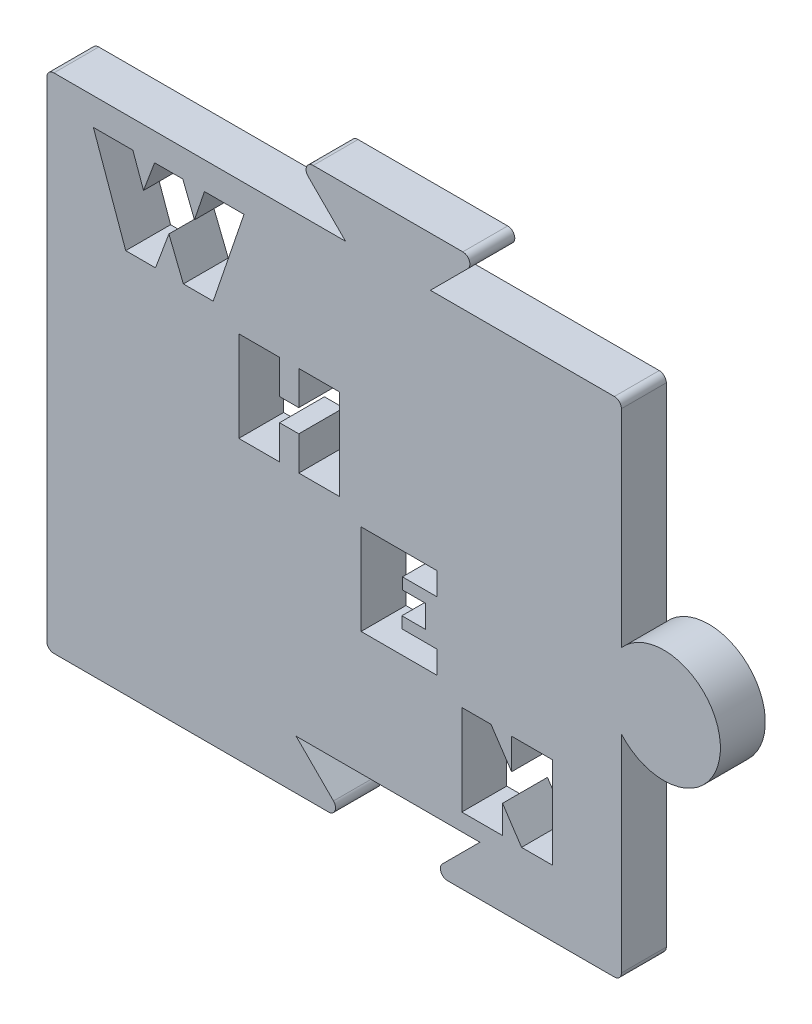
ISO-10303-21;
HEADER;
FILE_DESCRIPTION(('STEP AP214'),'2;1');
FILE_NAME('part.step','',(''),(''),'','','');
FILE_SCHEMA(('AUTOMOTIVE_DESIGN { 1 0 10303 214 1 1 1 1 }'));
ENDSEC;
DATA;
#1=APPLICATION_CONTEXT('core data for automotive mechanical design processes');
#2=APPLICATION_PROTOCOL_DEFINITION('international standard','automotive_design',2000,#1);
#3=PRODUCT_CONTEXT('',#1,'mechanical');
#4=PRODUCT('Part','Part','',(#3));
#5=PRODUCT_RELATED_PRODUCT_CATEGORY('part','',(#4));
#6=PRODUCT_DEFINITION_FORMATION('','',#4);
#7=PRODUCT_DEFINITION_CONTEXT('part definition',#1,'design');
#8=PRODUCT_DEFINITION('design','',#6,#7);
#9=PRODUCT_DEFINITION_SHAPE('','',#8);
#10=(LENGTH_UNIT() NAMED_UNIT(*) SI_UNIT(.MILLI.,.METRE.));
#11=(NAMED_UNIT(*) PLANE_ANGLE_UNIT() SI_UNIT($,.RADIAN.));
#12=(NAMED_UNIT(*) SI_UNIT($,.STERADIAN.) SOLID_ANGLE_UNIT());
#13=UNCERTAINTY_MEASURE_WITH_UNIT(LENGTH_MEASURE(1.E-05),#10,'distance_accuracy_value','');
#14=(GEOMETRIC_REPRESENTATION_CONTEXT(3) GLOBAL_UNCERTAINTY_ASSIGNED_CONTEXT((#13)) GLOBAL_UNIT_ASSIGNED_CONTEXT((#10,
#11,#12)) REPRESENTATION_CONTEXT('',''));
#15=CARTESIAN_POINT('',(0.,0.,0.));
#16=DIRECTION('',(0.,0.,1.));
#17=DIRECTION('',(1.,0.,0.));
#18=AXIS2_PLACEMENT_3D('',#15,#16,#17);
#19=CARTESIAN_POINT('',(43.64,17.78,3.175));
#20=DIRECTION('',(0.,0.,1.));
#21=DIRECTION('',(1.,0.,0.));
#22=AXIS2_PLACEMENT_3D('',#19,#20,#21);
#23=PLANE('',#22);
#24=DIRECTION('',(0.,-1.,0.));
#25=VECTOR('',#24,1.);
#26=CARTESIAN_POINT('',(25.1104923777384,14.6136766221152,3.175));
#27=LINE('',#26,#25);
#28=CARTESIAN_POINT('',(25.1104923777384,14.6136766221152,3.175));
#29=VERTEX_POINT('',#28);
#30=CARTESIAN_POINT('',(25.1104923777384,13.8126919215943,3.175));
#31=VERTEX_POINT('',#30);
#32=EDGE_CURVE('E556',#29,#31,#27,.T.);
#33=ORIENTED_EDGE('',*,*,#32,.T.);
#34=DIRECTION('',(1.,0.,0.));
#35=VECTOR('',#34,1.);
#36=CARTESIAN_POINT('',(25.1104923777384,13.8126919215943,3.175));
#37=LINE('',#36,#35);
#38=CARTESIAN_POINT('',(27.593544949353,13.8126919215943,3.175));
#39=VERTEX_POINT('',#38);
#40=EDGE_CURVE('E486',#31,#39,#37,.T.);
#41=ORIENTED_EDGE('',*,*,#40,.T.);
#42=DIRECTION('',(0.,-1.,0.));
#43=VECTOR('',#42,1.);
#44=CARTESIAN_POINT('',(27.593544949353,13.8126919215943,3.175));
#45=LINE('',#44,#43);
#46=CARTESIAN_POINT('',(27.593544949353,12.2107225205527,3.175));
#47=VERTEX_POINT('',#46);
#48=EDGE_CURVE('E582',#39,#47,#45,.T.);
#49=ORIENTED_EDGE('',*,*,#48,.T.);
#50=DIRECTION('',(-1.,0.,0.));
#51=VECTOR('',#50,1.);
#52=CARTESIAN_POINT('',(27.593544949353,12.2107225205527,3.175));
#53=LINE('',#52,#51);
#54=CARTESIAN_POINT('',(22.2269474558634,12.2107225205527,3.175));
#55=VERTEX_POINT('',#54);
#56=EDGE_CURVE('E585',#47,#55,#53,.T.);
#57=ORIENTED_EDGE('',*,*,#56,.T.);
#58=DIRECTION('',(0.,1.,0.));
#59=VECTOR('',#58,1.);
#60=CARTESIAN_POINT('',(22.2269474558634,12.2107225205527,3.175));
#61=LINE('',#60,#59);
#62=CARTESIAN_POINT('',(22.2269474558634,18.6186001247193,3.175));
#63=VERTEX_POINT('',#62);
#64=EDGE_CURVE('E588',#55,#63,#61,.T.);
#65=ORIENTED_EDGE('',*,*,#64,.T.);
#66=DIRECTION('',(1.,0.,0.));
#67=VECTOR('',#66,1.);
#68=CARTESIAN_POINT('',(22.2269474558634,18.6186001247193,3.175));
#69=LINE('',#68,#67);
#70=CARTESIAN_POINT('',(27.593544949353,18.6186001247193,3.175));
#71=VERTEX_POINT('',#70);
#72=EDGE_CURVE('E591',#63,#71,#69,.T.);
#73=ORIENTED_EDGE('',*,*,#72,.T.);
#74=DIRECTION('',(0.,-1.,0.));
#75=VECTOR('',#74,1.);
#76=CARTESIAN_POINT('',(27.593544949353,18.6186001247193,3.175));
#77=LINE('',#76,#75);
#78=CARTESIAN_POINT('',(27.593544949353,17.0166307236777,3.175));
#79=VERTEX_POINT('',#78);
#80=EDGE_CURVE('E594',#71,#79,#77,.T.);
#81=ORIENTED_EDGE('',*,*,#80,.T.);
#82=DIRECTION('',(-1.,0.,0.));
#83=VECTOR('',#82,1.);
#84=CARTESIAN_POINT('',(27.593544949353,17.0166307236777,3.175));
#85=LINE('',#84,#83);
#86=CARTESIAN_POINT('',(25.1505416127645,17.0166307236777,3.175));
#87=VERTEX_POINT('',#86);
#88=EDGE_CURVE('E597',#79,#87,#85,.T.);
#89=ORIENTED_EDGE('',*,*,#88,.T.);
#90=DIRECTION('',(0.,-1.,0.));
#91=VECTOR('',#90,1.);
#92=CARTESIAN_POINT('',(25.1505416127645,17.0166307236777,3.175));
#93=LINE('',#92,#91);
#94=CARTESIAN_POINT('',(25.1505416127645,16.2156460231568,3.175));
#95=VERTEX_POINT('',#94);
#96=EDGE_CURVE('E600',#87,#95,#93,.T.);
#97=ORIENTED_EDGE('',*,*,#96,.T.);
#98=DIRECTION('',(1.,0.,0.));
#99=VECTOR('',#98,1.);
#100=CARTESIAN_POINT('',(25.1505416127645,16.2156460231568,3.175));
#101=LINE('',#100,#99);
#102=CARTESIAN_POINT('',(26.7925602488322,16.2156460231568,3.175));
#103=VERTEX_POINT('',#102);
#104=EDGE_CURVE('E603',#95,#103,#101,.T.);
#105=ORIENTED_EDGE('',*,*,#104,.T.);
#106=DIRECTION('',(0.,-1.,0.));
#107=VECTOR('',#106,1.);
#108=CARTESIAN_POINT('',(26.7925602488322,16.2156460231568,3.175));
#109=LINE('',#108,#107);
#110=CARTESIAN_POINT('',(26.7925602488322,14.6136766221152,3.175));
#111=VERTEX_POINT('',#110);
#112=EDGE_CURVE('E606',#103,#111,#109,.T.);
#113=ORIENTED_EDGE('',*,*,#112,.T.);
#114=DIRECTION('',(-1.,0.,0.));
#115=VECTOR('',#114,1.);
#116=CARTESIAN_POINT('',(26.7925602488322,14.6136766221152,3.175));
#117=LINE('',#116,#115);
#118=EDGE_CURVE('E609',#111,#29,#117,.T.);
#119=ORIENTED_EDGE('',*,*,#118,.T.);
#120=EDGE_LOOP('',(#33,#41,#49,#57,#65,#73,#81,#89,#97,#105,#113,#119));
#121=FACE_BOUND('',#120,.T.);
#122=DIRECTION('',(-0.371547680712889,0.928413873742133,0.));
#123=VECTOR('',#122,1.);
#124=CARTESIAN_POINT('',(9.65648442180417,27.2107225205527,3.175));
#125=LINE('',#124,#123);
#126=CARTESIAN_POINT('',(9.65648442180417,27.2107225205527,3.175));
#127=VERTEX_POINT('',#126);
#128=CARTESIAN_POINT('',(8.63522892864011,29.7626097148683,3.175));
#129=VERTEX_POINT('',#128);
#130=EDGE_CURVE('E730',#127,#129,#125,.T.);
#131=ORIENTED_EDGE('',*,*,#130,.T.);
#132=DIRECTION('',(-0.348855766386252,-0.937176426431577,0.));
#133=VECTOR('',#132,1.);
#134=CARTESIAN_POINT('',(8.63522892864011,29.7626097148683,3.175));
#135=LINE('',#134,#133);
#136=CARTESIAN_POINT('',(7.68531113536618,27.2107225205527,3.175));
#137=VERTEX_POINT('',#136);
#138=EDGE_CURVE('E726',#129,#137,#135,.T.);
#139=ORIENTED_EDGE('',*,*,#138,.T.);
#140=DIRECTION('',(-1.,0.,0.));
#141=VECTOR('',#140,1.);
#142=CARTESIAN_POINT('',(7.68531113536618,27.2107225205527,3.175));
#143=LINE('',#142,#141);
#144=CARTESIAN_POINT('',(5.57897168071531,27.2107225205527,3.175));
#145=VERTEX_POINT('',#144);
#146=EDGE_CURVE('E758',#137,#145,#143,.T.);
#147=ORIENTED_EDGE('',*,*,#146,.T.);
#148=DIRECTION('',(-0.335916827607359,0.941891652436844,0.));
#149=VECTOR('',#148,1.);
#150=CARTESIAN_POINT('',(5.57897168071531,27.2107225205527,3.175));
#151=LINE('',#150,#149);
#152=CARTESIAN_POINT('',(3.2936622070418,33.6186001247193,3.175));
#153=VERTEX_POINT('',#152);
#154=EDGE_CURVE('E761',#145,#153,#151,.T.);
#155=ORIENTED_EDGE('',*,*,#154,.T.);
#156=DIRECTION('',(1.,0.,0.));
#157=VECTOR('',#156,1.);
#158=CARTESIAN_POINT('',(3.2936622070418,33.6186001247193,3.175));
#159=LINE('',#158,#157);
#160=CARTESIAN_POINT('',(6.08709635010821,33.6186001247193,3.175));
#161=VERTEX_POINT('',#160);
#162=EDGE_CURVE('E764',#153,#161,#159,.T.);
#163=ORIENTED_EDGE('',*,*,#162,.T.);
#164=DIRECTION('',(0.337941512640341,-0.941167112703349,0.));
#165=VECTOR('',#164,1.);
#166=CARTESIAN_POINT('',(6.08709635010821,33.6186001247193,3.175));
#167=LINE('',#166,#165);
#168=CARTESIAN_POINT('',(6.83801950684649,31.5272791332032,3.175));
#169=VERTEX_POINT('',#168);
#170=EDGE_CURVE('E767',#161,#169,#167,.T.);
#171=ORIENTED_EDGE('',*,*,#170,.T.);
#172=DIRECTION('',(0.352779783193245,0.935706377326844,0.));
#173=VECTOR('',#172,1.);
#174=CARTESIAN_POINT('',(6.83801950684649,31.5272791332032,3.175));
#175=LINE('',#174,#173);
#176=CARTESIAN_POINT('',(7.62648882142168,33.6186001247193,3.175));
#177=VERTEX_POINT('',#176);
#178=EDGE_CURVE('E770',#169,#177,#175,.T.);
#179=ORIENTED_EDGE('',*,*,#178,.T.);
#180=DIRECTION('',(1.,0.,0.));
#181=VECTOR('',#180,1.);
#182=CARTESIAN_POINT('',(7.62648882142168,33.6186001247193,3.175));
#183=LINE('',#182,#181);
#184=CARTESIAN_POINT('',(9.613932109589,33.6186001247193,3.175));
#185=VERTEX_POINT('',#184);
#186=EDGE_CURVE('E773',#177,#185,#183,.T.);
#187=ORIENTED_EDGE('',*,*,#186,.T.);
#188=DIRECTION('',(0.36783795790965,-0.92988990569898,0.));
#189=VECTOR('',#188,1.);
#190=CARTESIAN_POINT('',(9.613932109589,33.6186001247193,3.175));
#191=LINE('',#190,#189);
#192=CARTESIAN_POINT('',(10.4411991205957,31.5272791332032,3.175));
#193=VERTEX_POINT('',#192);
#194=EDGE_CURVE('E776',#185,#193,#191,.T.);
#195=ORIENTED_EDGE('',*,*,#194,.T.);
#196=DIRECTION('',(0.320306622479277,0.947313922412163,0.));
#197=VECTOR('',#196,1.);
#198=CARTESIAN_POINT('',(10.4411991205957,31.5272791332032,3.175));
#199=LINE('',#198,#197);
#200=CARTESIAN_POINT('',(11.1483184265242,33.6186001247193,3.175));
#201=VERTEX_POINT('',#200);
#202=EDGE_CURVE('E779',#193,#201,#199,.T.);
#203=ORIENTED_EDGE('',*,*,#202,.T.);
#204=DIRECTION('',(1.,0.,0.));
#205=VECTOR('',#204,1.);
#206=CARTESIAN_POINT('',(11.1483184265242,33.6186001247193,3.175));
#207=LINE('',#206,#205);
#208=CARTESIAN_POINT('',(13.9467587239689,33.6186001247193,3.175));
#209=VERTEX_POINT('',#208);
#210=EDGE_CURVE('E782',#201,#209,#207,.T.);
#211=ORIENTED_EDGE('',*,*,#210,.T.);
#212=DIRECTION('',(-0.321935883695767,-0.946761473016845,0.));
#213=VECTOR('',#212,1.);
#214=CARTESIAN_POINT('',(13.9467587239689,33.6186001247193,3.175));
#215=LINE('',#214,#213);
#216=CARTESIAN_POINT('',(11.7678300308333,27.2107225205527,3.175));
#217=VERTEX_POINT('',#216);
#218=EDGE_CURVE('E785',#209,#217,#215,.T.);
#219=ORIENTED_EDGE('',*,*,#218,.T.);
#220=DIRECTION('',(-1.,0.,0.));
#221=VECTOR('',#220,1.);
#222=CARTESIAN_POINT('',(11.7678300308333,27.2107225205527,3.175));
#223=LINE('',#222,#221);
#224=EDGE_CURVE('E788',#217,#127,#223,.T.);
#225=ORIENTED_EDGE('',*,*,#224,.T.);
#226=EDGE_LOOP('',(#131,#139,#147,#155,#163,#171,#179,#187,#195,#203,#211,#219,#225));
#227=FACE_BOUND('',#226,.T.);
#228=DIRECTION('',(0.,-1.,0.));
#229=VECTOR('',#228,1.);
#230=CARTESIAN_POINT('',(0.,35.56,3.175));
#231=LINE('',#230,#229);
#232=CARTESIAN_POINT('',(0.,35.06,3.175));
#233=VERTEX_POINT('',#232);
#234=CARTESIAN_POINT('',(0.,0.5,3.175));
#235=VERTEX_POINT('',#234);
#236=EDGE_CURVE('E821',#233,#235,#231,.T.);
#237=ORIENTED_EDGE('',*,*,#236,.T.);
#238=CARTESIAN_POINT('',(0.5,0.5,3.175));
#239=DIRECTION('',(0.,0.,1.));
#240=DIRECTION('',(1.,0.,0.));
#241=AXIS2_PLACEMENT_3D('',#238,#239,#240);
#242=CIRCLE('',#241,0.5);
#243=CARTESIAN_POINT('',(0.5,0.,3.175));
#244=VERTEX_POINT('',#243);
#245=EDGE_CURVE('E946',#235,#244,#242,.T.);
#246=ORIENTED_EDGE('',*,*,#245,.T.);
#247=DIRECTION('',(1.,0.,0.));
#248=VECTOR('',#247,1.);
#249=CARTESIAN_POINT('',(0.,0.,3.175));
#250=LINE('',#249,#248);
#251=CARTESIAN_POINT('',(19.9228932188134,0.,3.175));
#252=VERTEX_POINT('',#251);
#253=EDGE_CURVE('E824',#244,#252,#250,.T.);
#254=ORIENTED_EDGE('',*,*,#253,.T.);
#255=CARTESIAN_POINT('',(19.9228932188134,0.5,3.175));
#256=DIRECTION('',(0.,0.,1.));
#257=DIRECTION('',(1.,0.,0.));
#258=AXIS2_PLACEMENT_3D('',#255,#256,#257);
#259=CIRCLE('',#258,0.5);
#260=CARTESIAN_POINT('',(20.2764466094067,0.853553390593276,3.175));
#261=VERTEX_POINT('',#260);
#262=EDGE_CURVE('E939',#252,#261,#259,.T.);
#263=ORIENTED_EDGE('',*,*,#262,.T.);
#264=DIRECTION('',(-0.70710678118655,0.707106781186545,0.));
#265=VECTOR('',#264,1.);
#266=CARTESIAN_POINT('',(17.63,3.5,3.175));
#267=LINE('',#266,#265);
#268=CARTESIAN_POINT('',(17.63,3.5,3.175));
#269=VERTEX_POINT('',#268);
#270=EDGE_CURVE('E828',#261,#269,#267,.T.);
#271=ORIENTED_EDGE('',*,*,#270,.T.);
#272=DIRECTION('',(1.,0.,0.));
#273=VECTOR('',#272,1.);
#274=CARTESIAN_POINT('',(30.63,3.5,3.175));
#275=LINE('',#274,#273);
#276=CARTESIAN_POINT('',(30.63,3.5,3.175));
#277=VERTEX_POINT('',#276);
#278=EDGE_CURVE('E830',#269,#277,#275,.T.);
#279=ORIENTED_EDGE('',*,*,#278,.T.);
#280=DIRECTION('',(-0.70710678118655,-0.707106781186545,0.));
#281=VECTOR('',#280,1.);
#282=CARTESIAN_POINT('',(27.13,0.,3.175));
#283=LINE('',#282,#281);
#284=CARTESIAN_POINT('',(27.9835533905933,0.853553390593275,3.175));
#285=VERTEX_POINT('',#284);
#286=EDGE_CURVE('E832',#277,#285,#283,.T.);
#287=ORIENTED_EDGE('',*,*,#286,.T.);
#288=CARTESIAN_POINT('',(28.3371067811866,0.500000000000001,3.175));
#289=DIRECTION('',(0.,0.,1.));
#290=DIRECTION('',(1.,0.,0.));
#291=AXIS2_PLACEMENT_3D('',#288,#289,#290);
#292=CIRCLE('',#291,0.5);
#293=CARTESIAN_POINT('',(28.3371067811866,0.,3.175));
#294=VERTEX_POINT('',#293);
#295=EDGE_CURVE('E941',#285,#294,#292,.T.);
#296=ORIENTED_EDGE('',*,*,#295,.T.);
#297=DIRECTION('',(1.,0.,0.));
#298=VECTOR('',#297,1.);
#299=CARTESIAN_POINT('',(40.64,0.,3.175));
#300=LINE('',#299,#298);
#301=CARTESIAN_POINT('',(40.14,0.,3.175));
#302=VERTEX_POINT('',#301);
#303=EDGE_CURVE('E835',#294,#302,#300,.T.);
#304=ORIENTED_EDGE('',*,*,#303,.T.);
#305=CARTESIAN_POINT('',(40.14,0.5,3.175));
#306=DIRECTION('',(0.,0.,1.));
#307=DIRECTION('',(1.,0.,0.));
#308=AXIS2_PLACEMENT_3D('',#305,#306,#307);
#309=CIRCLE('',#308,0.5);
#310=CARTESIAN_POINT('',(40.64,0.5,3.175));
#311=VERTEX_POINT('',#310);
#312=EDGE_CURVE('E935',#302,#311,#309,.T.);
#313=ORIENTED_EDGE('',*,*,#312,.T.);
#314=DIRECTION('',(0.,1.,0.));
#315=VECTOR('',#314,1.);
#316=CARTESIAN_POINT('',(40.64,15.1342486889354,3.175));
#317=LINE('',#316,#315);
#318=CARTESIAN_POINT('',(40.64,15.1342486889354,3.175));
#319=VERTEX_POINT('',#318);
#320=EDGE_CURVE('E838',#311,#319,#317,.T.);
#321=ORIENTED_EDGE('',*,*,#320,.T.);
#322=CARTESIAN_POINT('',(43.64,17.78,3.175));
#323=DIRECTION('',(0.,0.,1.));
#324=DIRECTION('',(1.,0.,0.));
#325=AXIS2_PLACEMENT_3D('',#322,#323,#324);
#326=CIRCLE('',#325,4.);
#327=CARTESIAN_POINT('',(40.64,20.4257513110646,3.175));
#328=VERTEX_POINT('',#327);
#329=EDGE_CURVE('E840',#319,#328,#326,.T.);
#330=ORIENTED_EDGE('',*,*,#329,.T.);
#331=DIRECTION('',(0.,1.,0.));
#332=VECTOR('',#331,1.);
#333=CARTESIAN_POINT('',(40.64,35.56,3.175));
#334=LINE('',#333,#332);
#335=CARTESIAN_POINT('',(40.64,35.06,3.175));
#336=VERTEX_POINT('',#335);
#337=EDGE_CURVE('E842',#328,#336,#334,.T.);
#338=ORIENTED_EDGE('',*,*,#337,.T.);
#339=CARTESIAN_POINT('',(40.14,35.06,3.175));
#340=DIRECTION('',(0.,0.,1.));
#341=DIRECTION('',(1.,0.,0.));
#342=AXIS2_PLACEMENT_3D('',#339,#340,#341);
#343=CIRCLE('',#342,0.5);
#344=CARTESIAN_POINT('',(40.14,35.56,3.175));
#345=VERTEX_POINT('',#344);
#346=EDGE_CURVE('E937',#336,#345,#343,.T.);
#347=ORIENTED_EDGE('',*,*,#346,.T.);
#348=DIRECTION('',(-1.,0.,0.));
#349=VECTOR('',#348,1.);
#350=CARTESIAN_POINT('',(40.64,35.56,3.175));
#351=LINE('',#350,#349);
#352=CARTESIAN_POINT('',(27.13,35.56,3.175));
#353=VERTEX_POINT('',#352);
#354=EDGE_CURVE('E845',#345,#353,#351,.T.);
#355=ORIENTED_EDGE('',*,*,#354,.T.);
#356=DIRECTION('',(0.707106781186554,0.707106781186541,0.));
#357=VECTOR('',#356,1.);
#358=CARTESIAN_POINT('',(27.13,35.56,3.175));
#359=LINE('',#358,#357);
#360=CARTESIAN_POINT('',(29.7764466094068,38.2064466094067,3.175));
#361=VERTEX_POINT('',#360);
#362=EDGE_CURVE('E847',#353,#361,#359,.T.);
#363=ORIENTED_EDGE('',*,*,#362,.T.);
#364=CARTESIAN_POINT('',(29.4228932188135,38.56,3.175));
#365=DIRECTION('',(0.,0.,1.));
#366=DIRECTION('',(1.,0.,0.));
#367=AXIS2_PLACEMENT_3D('',#364,#365,#366);
#368=CIRCLE('',#367,0.5);
#369=CARTESIAN_POINT('',(29.4228932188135,39.06,3.175));
#370=VERTEX_POINT('',#369);
#371=EDGE_CURVE('E944',#361,#370,#368,.T.);
#372=ORIENTED_EDGE('',*,*,#371,.T.);
#373=DIRECTION('',(-1.,0.,0.));
#374=VECTOR('',#373,1.);
#375=CARTESIAN_POINT('',(17.6299999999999,39.06,3.175));
#376=LINE('',#375,#374);
#377=CARTESIAN_POINT('',(18.8371067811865,39.06,3.175));
#378=VERTEX_POINT('',#377);
#379=EDGE_CURVE('E850',#370,#378,#376,.T.);
#380=ORIENTED_EDGE('',*,*,#379,.T.);
#381=CARTESIAN_POINT('',(18.8371067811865,38.56,3.175));
#382=DIRECTION('',(0.,0.,1.));
#383=DIRECTION('',(1.,0.,0.));
#384=AXIS2_PLACEMENT_3D('',#381,#382,#383);
#385=CIRCLE('',#384,0.5);
#386=CARTESIAN_POINT('',(18.4835533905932,38.2064466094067,3.175));
#387=VERTEX_POINT('',#386);
#388=EDGE_CURVE('E56',#378,#387,#385,.T.);
#389=ORIENTED_EDGE('',*,*,#388,.T.);
#390=DIRECTION('',(0.707106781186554,-0.707106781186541,0.));
#391=VECTOR('',#390,1.);
#392=CARTESIAN_POINT('',(17.6299999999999,39.06,3.175));
#393=LINE('',#392,#391);
#394=CARTESIAN_POINT('',(21.13,35.56,3.175));
#395=VERTEX_POINT('',#394);
#396=EDGE_CURVE('E852',#387,#395,#393,.T.);
#397=ORIENTED_EDGE('',*,*,#396,.T.);
#398=DIRECTION('',(-1.,0.,0.));
#399=VECTOR('',#398,1.);
#400=CARTESIAN_POINT('',(0.,35.56,3.175));
#401=LINE('',#400,#399);
#402=CARTESIAN_POINT('',(0.499999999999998,35.56,3.175));
#403=VERTEX_POINT('',#402);
#404=EDGE_CURVE('E854',#395,#403,#401,.T.);
#405=ORIENTED_EDGE('',*,*,#404,.T.);
#406=CARTESIAN_POINT('',(0.499999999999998,35.06,3.175));
#407=DIRECTION('',(0.,0.,1.));
#408=DIRECTION('',(1.,0.,0.));
#409=AXIS2_PLACEMENT_3D('',#406,#407,#408);
#410=CIRCLE('',#409,0.5);
#411=EDGE_CURVE('E933',#403,#233,#410,.T.);
#412=ORIENTED_EDGE('',*,*,#411,.T.);
#413=EDGE_LOOP('',(#237,#246,#254,#263,#271,#279,#287,#296,#304,#313,#321,#330,#338,#347,#355,
#363,#372,#380,#389,#397,#405,#412));
#414=FACE_BOUND('',#413,.T.);
#415=DIRECTION('',(-1.,0.,0.));
#416=VECTOR('',#415,1.);
#417=CARTESIAN_POINT('',(17.8211969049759,22.1136766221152,3.175));
#418=LINE('',#417,#416);
#419=CARTESIAN_POINT('',(17.8211969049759,22.1136766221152,3.175));
#420=VERTEX_POINT('',#419);
#421=CARTESIAN_POINT('',(16.4595229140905,22.1136766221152,3.175));
#422=VERTEX_POINT('',#421);
#423=EDGE_CURVE('E643',#420,#422,#418,.T.);
#424=ORIENTED_EDGE('',*,*,#423,.T.);
#425=DIRECTION('',(0.,-1.,0.));
#426=VECTOR('',#425,1.);
#427=CARTESIAN_POINT('',(16.4595229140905,22.1136766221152,3.175));
#428=LINE('',#427,#426);
#429=CARTESIAN_POINT('',(16.4595229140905,19.7107225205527,3.175));
#430=VERTEX_POINT('',#429);
#431=EDGE_CURVE('E639',#422,#430,#428,.T.);
#432=ORIENTED_EDGE('',*,*,#431,.T.);
#433=DIRECTION('',(-1.,0.,0.));
#434=VECTOR('',#433,1.);
#435=CARTESIAN_POINT('',(16.4595229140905,19.7107225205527,3.175));
#436=LINE('',#435,#434);
#437=CARTESIAN_POINT('',(13.5759779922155,19.7107225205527,3.175));
#438=VERTEX_POINT('',#437);
#439=EDGE_CURVE('E669',#430,#438,#436,.T.);
#440=ORIENTED_EDGE('',*,*,#439,.T.);
#441=DIRECTION('',(0.,1.,0.));
#442=VECTOR('',#441,1.);
#443=CARTESIAN_POINT('',(13.5759779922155,19.7107225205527,3.175));
#444=LINE('',#443,#442);
#445=CARTESIAN_POINT('',(13.5759779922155,26.1186001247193,3.175));
#446=VERTEX_POINT('',#445);
#447=EDGE_CURVE('E672',#438,#446,#444,.T.);
#448=ORIENTED_EDGE('',*,*,#447,.T.);
#449=DIRECTION('',(1.,0.,0.));
#450=VECTOR('',#449,1.);
#451=CARTESIAN_POINT('',(13.5759779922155,26.1186001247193,3.175));
#452=LINE('',#451,#450);
#453=CARTESIAN_POINT('',(16.4595229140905,26.1186001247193,3.175));
#454=VERTEX_POINT('',#453);
#455=EDGE_CURVE('E675',#446,#454,#452,.T.);
#456=ORIENTED_EDGE('',*,*,#455,.T.);
#457=DIRECTION('',(0.,-1.,0.));
#458=VECTOR('',#457,1.);
#459=CARTESIAN_POINT('',(16.4595229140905,26.1186001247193,3.175));
#460=LINE('',#459,#458);
#461=CARTESIAN_POINT('',(16.4595229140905,23.7156460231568,3.175));
#462=VERTEX_POINT('',#461);
#463=EDGE_CURVE('E678',#454,#462,#460,.T.);
#464=ORIENTED_EDGE('',*,*,#463,.T.);
#465=DIRECTION('',(1.,0.,0.));
#466=VECTOR('',#465,1.);
#467=CARTESIAN_POINT('',(16.4595229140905,23.7156460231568,3.175));
#468=LINE('',#467,#466);
#469=CARTESIAN_POINT('',(17.8211969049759,23.7156460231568,3.175));
#470=VERTEX_POINT('',#469);
#471=EDGE_CURVE('E681',#462,#470,#468,.T.);
#472=ORIENTED_EDGE('',*,*,#471,.T.);
#473=DIRECTION('',(0.,1.,0.));
#474=VECTOR('',#473,1.);
#475=CARTESIAN_POINT('',(17.8211969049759,23.7156460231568,3.175));
#476=LINE('',#475,#474);
#477=CARTESIAN_POINT('',(17.8211969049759,26.1186001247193,3.175));
#478=VERTEX_POINT('',#477);
#479=EDGE_CURVE('E684',#470,#478,#476,.T.);
#480=ORIENTED_EDGE('',*,*,#479,.T.);
#481=DIRECTION('',(1.,0.,0.));
#482=VECTOR('',#481,1.);
#483=CARTESIAN_POINT('',(17.8211969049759,26.1186001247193,3.175));
#484=LINE('',#483,#482);
#485=CARTESIAN_POINT('',(20.7047418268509,26.1186001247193,3.175));
#486=VERTEX_POINT('',#485);
#487=EDGE_CURVE('E687',#478,#486,#484,.T.);
#488=ORIENTED_EDGE('',*,*,#487,.T.);
#489=DIRECTION('',(0.,-1.,0.));
#490=VECTOR('',#489,1.);
#491=CARTESIAN_POINT('',(20.7047418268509,26.1186001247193,3.175));
#492=LINE('',#491,#490);
#493=CARTESIAN_POINT('',(20.7047418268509,19.7107225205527,3.175));
#494=VERTEX_POINT('',#493);
#495=EDGE_CURVE('E690',#486,#494,#492,.T.);
#496=ORIENTED_EDGE('',*,*,#495,.T.);
#497=DIRECTION('',(-1.,0.,0.));
#498=VECTOR('',#497,1.);
#499=CARTESIAN_POINT('',(20.7047418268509,19.7107225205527,3.175));
#500=LINE('',#499,#498);
#501=CARTESIAN_POINT('',(17.8211969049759,19.7107225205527,3.175));
#502=VERTEX_POINT('',#501);
#503=EDGE_CURVE('E693',#494,#502,#500,.T.);
#504=ORIENTED_EDGE('',*,*,#503,.T.);
#505=DIRECTION('',(0.,1.,0.));
#506=VECTOR('',#505,1.);
#507=CARTESIAN_POINT('',(17.8211969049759,19.7107225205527,3.175));
#508=LINE('',#507,#506);
#509=EDGE_CURVE('E696',#502,#420,#508,.T.);
#510=ORIENTED_EDGE('',*,*,#509,.T.);
#511=EDGE_LOOP('',(#424,#432,#440,#448,#456,#464,#472,#480,#488,#496,#504,#510));
#512=FACE_BOUND('',#511,.T.);
#513=DIRECTION('',(1.,0.,0.));
#514=VECTOR('',#513,1.);
#515=CARTESIAN_POINT('',(32.8744063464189,11.1186001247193,3.175));
#516=LINE('',#515,#514);
#517=CARTESIAN_POINT('',(32.8744063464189,11.1186001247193,3.175));
#518=VERTEX_POINT('',#517);
#519=CARTESIAN_POINT('',(35.7579512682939,11.1186001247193,3.175));
#520=VERTEX_POINT('',#519);
#521=EDGE_CURVE('E479',#518,#520,#516,.T.);
#522=ORIENTED_EDGE('',*,*,#521,.T.);
#523=DIRECTION('',(0.,-1.,0.));
#524=VECTOR('',#523,1.);
#525=CARTESIAN_POINT('',(35.7579512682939,11.1186001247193,3.175));
#526=LINE('',#525,#524);
#527=CARTESIAN_POINT('',(35.7579512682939,4.66066097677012,3.175));
#528=VERTEX_POINT('',#527);
#529=EDGE_CURVE('E511',#520,#528,#526,.T.);
#530=ORIENTED_EDGE('',*,*,#529,.T.);
#531=DIRECTION('',(-1.,0.,0.));
#532=VECTOR('',#531,1.);
#533=CARTESIAN_POINT('',(35.7579512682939,4.66066097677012,3.175));
#534=LINE('',#533,#532);
#535=CARTESIAN_POINT('',(33.5740164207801,4.66066097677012,3.175));
#536=VERTEX_POINT('',#535);
#537=EDGE_CURVE('E485',#528,#536,#534,.T.);
#538=ORIENTED_EDGE('',*,*,#537,.T.);
#539=DIRECTION('',(-0.550777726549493,0.834651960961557,0.));
#540=VECTOR('',#539,1.);
#541=CARTESIAN_POINT('',(33.5740164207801,4.66066097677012,3.175));
#542=LINE('',#541,#540);
#543=CARTESIAN_POINT('',(32.2336185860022,6.69190811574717,3.175));
#544=VERTEX_POINT('',#543);
#545=EDGE_CURVE('E514',#536,#544,#542,.T.);
#546=ORIENTED_EDGE('',*,*,#545,.T.);
#547=DIRECTION('',(0.,-1.,0.));
#548=VECTOR('',#547,1.);
#549=CARTESIAN_POINT('',(32.2336185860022,6.69190811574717,3.175));
#550=LINE('',#549,#548);
#551=CARTESIAN_POINT('',(32.2336185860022,4.71072252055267,3.175));
#552=VERTEX_POINT('',#551);
#553=EDGE_CURVE('E517',#544,#552,#550,.T.);
#554=ORIENTED_EDGE('',*,*,#553,.T.);
#555=DIRECTION('',(-1.,0.,0.));
#556=VECTOR('',#555,1.);
#557=CARTESIAN_POINT('',(32.2336185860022,4.71072252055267,3.175));
#558=LINE('',#557,#556);
#559=CARTESIAN_POINT('',(29.3500736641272,4.71072252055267,3.175));
#560=VERTEX_POINT('',#559);
#561=EDGE_CURVE('E520',#552,#560,#558,.T.);
#562=ORIENTED_EDGE('',*,*,#561,.T.);
#563=DIRECTION('',(0.,1.,0.));
#564=VECTOR('',#563,1.);
#565=CARTESIAN_POINT('',(29.3500736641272,4.71072252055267,3.175));
#566=LINE('',#565,#564);
#567=CARTESIAN_POINT('',(29.3500736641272,11.1186001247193,3.175));
#568=VERTEX_POINT('',#567);
#569=EDGE_CURVE('E523',#560,#568,#566,.T.);
#570=ORIENTED_EDGE('',*,*,#569,.T.);
#571=DIRECTION('',(1.,0.,0.));
#572=VECTOR('',#571,1.);
#573=CARTESIAN_POINT('',(29.3500736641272,11.1186001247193,3.175));
#574=LINE('',#573,#572);
#575=CARTESIAN_POINT('',(31.413860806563,11.1186001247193,3.175));
#576=VERTEX_POINT('',#575);
#577=EDGE_CURVE('E526',#568,#576,#574,.T.);
#578=ORIENTED_EDGE('',*,*,#577,.T.);
#579=DIRECTION('',(0.556790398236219,-0.830653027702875,0.));
#580=VECTOR('',#579,1.);
#581=CARTESIAN_POINT('',(31.413860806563,11.1186001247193,3.175));
#582=LINE('',#581,#580);
#583=CARTESIAN_POINT('',(32.8744063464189,8.93967143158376,3.175));
#584=VERTEX_POINT('',#583);
#585=EDGE_CURVE('E529',#576,#584,#582,.T.);
#586=ORIENTED_EDGE('',*,*,#585,.T.);
#587=DIRECTION('',(0.,1.,0.));
#588=VECTOR('',#587,1.);
#589=CARTESIAN_POINT('',(32.8744063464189,8.93967143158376,3.175));
#590=LINE('',#589,#588);
#591=EDGE_CURVE('E532',#584,#518,#590,.T.);
#592=ORIENTED_EDGE('',*,*,#591,.T.);
#593=EDGE_LOOP('',(#522,#530,#538,#546,#554,#562,#570,#578,#586,#592));
#594=FACE_BOUND('',#593,.T.);
#595=ADVANCED_FACE('F35',(#121,#227,#414,#512,#594),#23,.T.);
#596=CARTESIAN_POINT('',(43.64,17.78,0.));
#597=DIRECTION('',(0.,0.,1.));
#598=DIRECTION('',(1.,0.,0.));
#599=AXIS2_PLACEMENT_3D('',#596,#597,#598);
#600=PLANE('',#599);
#601=DIRECTION('',(1.,0.,0.));
#602=VECTOR('',#601,1.);
#603=CARTESIAN_POINT('',(25.1104923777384,13.8126919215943,0.));
#604=LINE('',#603,#602);
#605=CARTESIAN_POINT('',(25.1104923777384,13.8126919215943,0.));
#606=VERTEX_POINT('',#605);
#607=CARTESIAN_POINT('',(27.593544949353,13.8126919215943,0.));
#608=VERTEX_POINT('',#607);
#609=EDGE_CURVE('E553',#606,#608,#604,.T.);
#610=ORIENTED_EDGE('',*,*,#609,.F.);
#611=DIRECTION('',(0.,-1.,0.));
#612=VECTOR('',#611,1.);
#613=CARTESIAN_POINT('',(25.1104923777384,14.6136766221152,0.));
#614=LINE('',#613,#612);
#615=CARTESIAN_POINT('',(25.1104923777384,14.6136766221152,0.));
#616=VERTEX_POINT('',#615);
#617=EDGE_CURVE('E577',#616,#606,#614,.T.);
#618=ORIENTED_EDGE('',*,*,#617,.F.);
#619=DIRECTION('',(-1.,0.,0.));
#620=VECTOR('',#619,1.);
#621=CARTESIAN_POINT('',(26.7925602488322,14.6136766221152,0.));
#622=LINE('',#621,#620);
#623=CARTESIAN_POINT('',(26.7925602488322,14.6136766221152,0.));
#624=VERTEX_POINT('',#623);
#625=EDGE_CURVE('E574',#624,#616,#622,.T.);
#626=ORIENTED_EDGE('',*,*,#625,.F.);
#627=DIRECTION('',(0.,-1.,0.));
#628=VECTOR('',#627,1.);
#629=CARTESIAN_POINT('',(26.7925602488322,16.2156460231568,0.));
#630=LINE('',#629,#628);
#631=CARTESIAN_POINT('',(26.7925602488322,16.2156460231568,0.));
#632=VERTEX_POINT('',#631);
#633=EDGE_CURVE('E572',#632,#624,#630,.T.);
#634=ORIENTED_EDGE('',*,*,#633,.F.);
#635=DIRECTION('',(1.,0.,0.));
#636=VECTOR('',#635,1.);
#637=CARTESIAN_POINT('',(25.1505416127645,16.2156460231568,0.));
#638=LINE('',#637,#636);
#639=CARTESIAN_POINT('',(25.1505416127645,16.2156460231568,0.));
#640=VERTEX_POINT('',#639);
#641=EDGE_CURVE('E570',#640,#632,#638,.T.);
#642=ORIENTED_EDGE('',*,*,#641,.F.);
#643=DIRECTION('',(0.,-1.,0.));
#644=VECTOR('',#643,1.);
#645=CARTESIAN_POINT('',(25.1505416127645,17.0166307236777,0.));
#646=LINE('',#645,#644);
#647=CARTESIAN_POINT('',(25.1505416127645,17.0166307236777,0.));
#648=VERTEX_POINT('',#647);
#649=EDGE_CURVE('E568',#648,#640,#646,.T.);
#650=ORIENTED_EDGE('',*,*,#649,.F.);
#651=DIRECTION('',(-1.,0.,0.));
#652=VECTOR('',#651,1.);
#653=CARTESIAN_POINT('',(27.593544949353,17.0166307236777,0.));
#654=LINE('',#653,#652);
#655=CARTESIAN_POINT('',(27.593544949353,17.0166307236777,0.));
#656=VERTEX_POINT('',#655);
#657=EDGE_CURVE('E566',#656,#648,#654,.T.);
#658=ORIENTED_EDGE('',*,*,#657,.F.);
#659=DIRECTION('',(0.,-1.,0.));
#660=VECTOR('',#659,1.);
#661=CARTESIAN_POINT('',(27.593544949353,18.6186001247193,0.));
#662=LINE('',#661,#660);
#663=CARTESIAN_POINT('',(27.593544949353,18.6186001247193,0.));
#664=VERTEX_POINT('',#663);
#665=EDGE_CURVE('E564',#664,#656,#662,.T.);
#666=ORIENTED_EDGE('',*,*,#665,.F.);
#667=DIRECTION('',(1.,0.,0.));
#668=VECTOR('',#667,1.);
#669=CARTESIAN_POINT('',(22.2269474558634,18.6186001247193,0.));
#670=LINE('',#669,#668);
#671=CARTESIAN_POINT('',(22.2269474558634,18.6186001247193,0.));
#672=VERTEX_POINT('',#671);
#673=EDGE_CURVE('E562',#672,#664,#670,.T.);
#674=ORIENTED_EDGE('',*,*,#673,.F.);
#675=DIRECTION('',(0.,1.,0.));
#676=VECTOR('',#675,1.);
#677=CARTESIAN_POINT('',(22.2269474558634,12.2107225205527,0.));
#678=LINE('',#677,#676);
#679=CARTESIAN_POINT('',(22.2269474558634,12.2107225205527,0.));
#680=VERTEX_POINT('',#679);
#681=EDGE_CURVE('E560',#680,#672,#678,.T.);
#682=ORIENTED_EDGE('',*,*,#681,.F.);
#683=DIRECTION('',(-1.,0.,0.));
#684=VECTOR('',#683,1.);
#685=CARTESIAN_POINT('',(27.593544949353,12.2107225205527,0.));
#686=LINE('',#685,#684);
#687=CARTESIAN_POINT('',(27.593544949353,12.2107225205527,0.));
#688=VERTEX_POINT('',#687);
#689=EDGE_CURVE('E558',#688,#680,#686,.T.);
#690=ORIENTED_EDGE('',*,*,#689,.F.);
#691=DIRECTION('',(0.,-1.,0.));
#692=VECTOR('',#691,1.);
#693=CARTESIAN_POINT('',(27.593544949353,13.8126919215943,0.));
#694=LINE('',#693,#692);
#695=EDGE_CURVE('E555',#608,#688,#694,.T.);
#696=ORIENTED_EDGE('',*,*,#695,.F.);
#697=EDGE_LOOP('',(#610,#618,#626,#634,#642,#650,#658,#666,#674,#682,#690,#696));
#698=FACE_BOUND('',#697,.T.);
#699=DIRECTION('',(-0.348855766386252,-0.937176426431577,0.));
#700=VECTOR('',#699,1.);
#701=CARTESIAN_POINT('',(8.63522892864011,29.7626097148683,0.));
#702=LINE('',#701,#700);
#703=CARTESIAN_POINT('',(8.63522892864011,29.7626097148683,0.));
#704=VERTEX_POINT('',#703);
#705=CARTESIAN_POINT('',(7.68531113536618,27.2107225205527,0.));
#706=VERTEX_POINT('',#705);
#707=EDGE_CURVE('E727',#704,#706,#702,.T.);
#708=ORIENTED_EDGE('',*,*,#707,.F.);
#709=DIRECTION('',(-0.371547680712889,0.928413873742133,0.));
#710=VECTOR('',#709,1.);
#711=CARTESIAN_POINT('',(9.65648442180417,27.2107225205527,0.));
#712=LINE('',#711,#710);
#713=CARTESIAN_POINT('',(9.65648442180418,27.2107225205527,0.));
#714=VERTEX_POINT('',#713);
#715=EDGE_CURVE('E753',#714,#704,#712,.T.);
#716=ORIENTED_EDGE('',*,*,#715,.F.);
#717=DIRECTION('',(-1.,0.,0.));
#718=VECTOR('',#717,1.);
#719=CARTESIAN_POINT('',(11.7678300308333,27.2107225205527,0.));
#720=LINE('',#719,#718);
#721=CARTESIAN_POINT('',(11.7678300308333,27.2107225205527,0.));
#722=VERTEX_POINT('',#721);
#723=EDGE_CURVE('E750',#722,#714,#720,.T.);
#724=ORIENTED_EDGE('',*,*,#723,.F.);
#725=DIRECTION('',(-0.321935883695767,-0.946761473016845,0.));
#726=VECTOR('',#725,1.);
#727=CARTESIAN_POINT('',(13.9467587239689,33.6186001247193,0.));
#728=LINE('',#727,#726);
#729=CARTESIAN_POINT('',(13.9467587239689,33.6186001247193,0.));
#730=VERTEX_POINT('',#729);
#731=EDGE_CURVE('E748',#730,#722,#728,.T.);
#732=ORIENTED_EDGE('',*,*,#731,.F.);
#733=DIRECTION('',(1.,0.,0.));
#734=VECTOR('',#733,1.);
#735=CARTESIAN_POINT('',(11.1483184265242,33.6186001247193,0.));
#736=LINE('',#735,#734);
#737=CARTESIAN_POINT('',(11.1483184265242,33.6186001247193,0.));
#738=VERTEX_POINT('',#737);
#739=EDGE_CURVE('E746',#738,#730,#736,.T.);
#740=ORIENTED_EDGE('',*,*,#739,.F.);
#741=DIRECTION('',(0.320306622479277,0.947313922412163,0.));
#742=VECTOR('',#741,1.);
#743=CARTESIAN_POINT('',(10.4411991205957,31.5272791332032,0.));
#744=LINE('',#743,#742);
#745=CARTESIAN_POINT('',(10.4411991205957,31.5272791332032,0.));
#746=VERTEX_POINT('',#745);
#747=EDGE_CURVE('E744',#746,#738,#744,.T.);
#748=ORIENTED_EDGE('',*,*,#747,.F.);
#749=DIRECTION('',(0.36783795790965,-0.92988990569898,0.));
#750=VECTOR('',#749,1.);
#751=CARTESIAN_POINT('',(9.613932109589,33.6186001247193,0.));
#752=LINE('',#751,#750);
#753=CARTESIAN_POINT('',(9.613932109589,33.6186001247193,0.));
#754=VERTEX_POINT('',#753);
#755=EDGE_CURVE('E742',#754,#746,#752,.T.);
#756=ORIENTED_EDGE('',*,*,#755,.F.);
#757=DIRECTION('',(1.,0.,0.));
#758=VECTOR('',#757,1.);
#759=CARTESIAN_POINT('',(7.62648882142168,33.6186001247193,0.));
#760=LINE('',#759,#758);
#761=CARTESIAN_POINT('',(7.62648882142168,33.6186001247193,0.));
#762=VERTEX_POINT('',#761);
#763=EDGE_CURVE('E740',#762,#754,#760,.T.);
#764=ORIENTED_EDGE('',*,*,#763,.F.);
#765=DIRECTION('',(0.352779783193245,0.935706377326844,0.));
#766=VECTOR('',#765,1.);
#767=CARTESIAN_POINT('',(6.83801950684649,31.5272791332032,0.));
#768=LINE('',#767,#766);
#769=CARTESIAN_POINT('',(6.83801950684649,31.5272791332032,0.));
#770=VERTEX_POINT('',#769);
#771=EDGE_CURVE('E738',#770,#762,#768,.T.);
#772=ORIENTED_EDGE('',*,*,#771,.F.);
#773=DIRECTION('',(0.337941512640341,-0.941167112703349,0.));
#774=VECTOR('',#773,1.);
#775=CARTESIAN_POINT('',(6.08709635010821,33.6186001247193,0.));
#776=LINE('',#775,#774);
#777=CARTESIAN_POINT('',(6.08709635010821,33.6186001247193,0.));
#778=VERTEX_POINT('',#777);
#779=EDGE_CURVE('E736',#778,#770,#776,.T.);
#780=ORIENTED_EDGE('',*,*,#779,.F.);
#781=DIRECTION('',(1.,0.,0.));
#782=VECTOR('',#781,1.);
#783=CARTESIAN_POINT('',(3.2936622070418,33.6186001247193,0.));
#784=LINE('',#783,#782);
#785=CARTESIAN_POINT('',(3.2936622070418,33.6186001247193,0.));
#786=VERTEX_POINT('',#785);
#787=EDGE_CURVE('E734',#786,#778,#784,.T.);
#788=ORIENTED_EDGE('',*,*,#787,.F.);
#789=DIRECTION('',(-0.335916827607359,0.941891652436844,0.));
#790=VECTOR('',#789,1.);
#791=CARTESIAN_POINT('',(5.57897168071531,27.2107225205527,0.));
#792=LINE('',#791,#790);
#793=CARTESIAN_POINT('',(5.57897168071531,27.2107225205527,0.));
#794=VERTEX_POINT('',#793);
#795=EDGE_CURVE('E732',#794,#786,#792,.T.);
#796=ORIENTED_EDGE('',*,*,#795,.F.);
#797=DIRECTION('',(-1.,0.,0.));
#798=VECTOR('',#797,1.);
#799=CARTESIAN_POINT('',(7.68531113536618,27.2107225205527,0.));
#800=LINE('',#799,#798);
#801=EDGE_CURVE('E729',#706,#794,#800,.T.);
#802=ORIENTED_EDGE('',*,*,#801,.F.);
#803=EDGE_LOOP('',(#708,#716,#724,#732,#740,#748,#756,#764,#772,#780,#788,#796,#802));
#804=FACE_BOUND('',#803,.T.);
#805=DIRECTION('',(1.,0.,0.));
#806=VECTOR('',#805,1.);
#807=CARTESIAN_POINT('',(0.,0.,0.));
#808=LINE('',#807,#806);
#809=CARTESIAN_POINT('',(0.5,0.,0.));
#810=VERTEX_POINT('',#809);
#811=CARTESIAN_POINT('',(19.9228932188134,0.,0.));
#812=VERTEX_POINT('',#811);
#813=EDGE_CURVE('E859',#810,#812,#808,.T.);
#814=ORIENTED_EDGE('',*,*,#813,.F.);
#815=CARTESIAN_POINT('',(0.5,0.5,0.));
#816=DIRECTION('',(0.,0.,1.));
#817=DIRECTION('',(1.,0.,0.));
#818=AXIS2_PLACEMENT_3D('',#815,#816,#817);
#819=CIRCLE('',#818,0.5);
#820=CARTESIAN_POINT('',(0.,0.5,0.));
#821=VERTEX_POINT('',#820);
#822=EDGE_CURVE('E926',#810,#821,#819,.F.);
#823=ORIENTED_EDGE('',*,*,#822,.T.);
#824=DIRECTION('',(0.,-1.,0.));
#825=VECTOR('',#824,1.);
#826=CARTESIAN_POINT('',(0.,35.56,0.));
#827=LINE('',#826,#825);
#828=CARTESIAN_POINT('',(0.,35.06,0.));
#829=VERTEX_POINT('',#828);
#830=EDGE_CURVE('E820',#829,#821,#827,.T.);
#831=ORIENTED_EDGE('',*,*,#830,.F.);
#832=CARTESIAN_POINT('',(0.499999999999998,35.06,0.));
#833=DIRECTION('',(0.,0.,1.));
#834=DIRECTION('',(1.,0.,0.));
#835=AXIS2_PLACEMENT_3D('',#832,#833,#834);
#836=CIRCLE('',#835,0.5);
#837=CARTESIAN_POINT('',(0.499999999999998,35.56,0.));
#838=VERTEX_POINT('',#837);
#839=EDGE_CURVE('E912',#829,#838,#836,.F.);
#840=ORIENTED_EDGE('',*,*,#839,.T.);
#841=DIRECTION('',(-1.,0.,0.));
#842=VECTOR('',#841,1.);
#843=CARTESIAN_POINT('',(0.,35.56,0.));
#844=LINE('',#843,#842);
#845=CARTESIAN_POINT('',(21.13,35.56,0.));
#846=VERTEX_POINT('',#845);
#847=EDGE_CURVE('E825',#846,#838,#844,.T.);
#848=ORIENTED_EDGE('',*,*,#847,.F.);
#849=DIRECTION('',(0.707106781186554,-0.707106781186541,0.));
#850=VECTOR('',#849,1.);
#851=CARTESIAN_POINT('',(17.6299999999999,39.06,0.));
#852=LINE('',#851,#850);
#853=CARTESIAN_POINT('',(18.4835533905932,38.2064466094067,0.));
#854=VERTEX_POINT('',#853);
#855=EDGE_CURVE('E887',#854,#846,#852,.T.);
#856=ORIENTED_EDGE('',*,*,#855,.F.);
#857=CARTESIAN_POINT('',(18.8371067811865,38.56,0.));
#858=DIRECTION('',(0.,0.,1.));
#859=DIRECTION('',(1.,0.,0.));
#860=AXIS2_PLACEMENT_3D('',#857,#858,#859);
#861=CIRCLE('',#860,0.5);
#862=CARTESIAN_POINT('',(18.8371067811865,39.06,0.));
#863=VERTEX_POINT('',#862);
#864=EDGE_CURVE('E922',#854,#863,#861,.F.);
#865=ORIENTED_EDGE('',*,*,#864,.T.);
#866=DIRECTION('',(-1.,0.,0.));
#867=VECTOR('',#866,1.);
#868=CARTESIAN_POINT('',(17.6299999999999,39.06,0.));
#869=LINE('',#868,#867);
#870=CARTESIAN_POINT('',(29.4228932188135,39.06,0.));
#871=VERTEX_POINT('',#870);
#872=EDGE_CURVE('E884',#871,#863,#869,.T.);
#873=ORIENTED_EDGE('',*,*,#872,.F.);
#874=CARTESIAN_POINT('',(29.4228932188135,38.56,0.));
#875=DIRECTION('',(0.,0.,1.));
#876=DIRECTION('',(1.,0.,0.));
#877=AXIS2_PLACEMENT_3D('',#874,#875,#876);
#878=CIRCLE('',#877,0.5);
#879=CARTESIAN_POINT('',(29.7764466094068,38.2064466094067,0.));
#880=VERTEX_POINT('',#879);
#881=EDGE_CURVE('E924',#871,#880,#878,.F.);
#882=ORIENTED_EDGE('',*,*,#881,.T.);
#883=DIRECTION('',(0.707106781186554,0.707106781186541,0.));
#884=VECTOR('',#883,1.);
#885=CARTESIAN_POINT('',(27.13,35.56,0.));
#886=LINE('',#885,#884);
#887=CARTESIAN_POINT('',(27.13,35.56,0.));
#888=VERTEX_POINT('',#887);
#889=EDGE_CURVE('E881',#888,#880,#886,.T.);
#890=ORIENTED_EDGE('',*,*,#889,.F.);
#891=DIRECTION('',(-1.,0.,0.));
#892=VECTOR('',#891,1.);
#893=CARTESIAN_POINT('',(40.64,35.56,0.));
#894=LINE('',#893,#892);
#895=CARTESIAN_POINT('',(40.14,35.56,0.));
#896=VERTEX_POINT('',#895);
#897=EDGE_CURVE('E879',#896,#888,#894,.T.);
#898=ORIENTED_EDGE('',*,*,#897,.F.);
#899=CARTESIAN_POINT('',(40.14,35.06,0.));
#900=DIRECTION('',(0.,0.,1.));
#901=DIRECTION('',(1.,0.,0.));
#902=AXIS2_PLACEMENT_3D('',#899,#900,#901);
#903=CIRCLE('',#902,0.5);
#904=CARTESIAN_POINT('',(40.64,35.06,0.));
#905=VERTEX_POINT('',#904);
#906=EDGE_CURVE('E916',#896,#905,#903,.F.);
#907=ORIENTED_EDGE('',*,*,#906,.T.);
#908=DIRECTION('',(0.,1.,0.));
#909=VECTOR('',#908,1.);
#910=CARTESIAN_POINT('',(40.64,35.56,0.));
#911=LINE('',#910,#909);
#912=CARTESIAN_POINT('',(40.64,20.4257513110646,0.));
#913=VERTEX_POINT('',#912);
#914=EDGE_CURVE('E876',#913,#905,#911,.T.);
#915=ORIENTED_EDGE('',*,*,#914,.F.);
#916=CARTESIAN_POINT('',(43.64,17.78,0.));
#917=DIRECTION('',(0.,0.,1.));
#918=DIRECTION('',(1.,0.,0.));
#919=AXIS2_PLACEMENT_3D('',#916,#917,#918);
#920=CIRCLE('',#919,4.);
#921=CARTESIAN_POINT('',(40.64,15.1342486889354,0.));
#922=VERTEX_POINT('',#921);
#923=EDGE_CURVE('E874',#922,#913,#920,.T.);
#924=ORIENTED_EDGE('',*,*,#923,.F.);
#925=DIRECTION('',(0.,1.,0.));
#926=VECTOR('',#925,1.);
#927=CARTESIAN_POINT('',(40.64,15.1342486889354,0.));
#928=LINE('',#927,#926);
#929=CARTESIAN_POINT('',(40.64,0.5,0.));
#930=VERTEX_POINT('',#929);
#931=EDGE_CURVE('E872',#930,#922,#928,.T.);
#932=ORIENTED_EDGE('',*,*,#931,.F.);
#933=CARTESIAN_POINT('',(40.14,0.5,0.));
#934=DIRECTION('',(0.,0.,1.));
#935=DIRECTION('',(1.,0.,0.));
#936=AXIS2_PLACEMENT_3D('',#933,#934,#935);
#937=CIRCLE('',#936,0.5);
#938=CARTESIAN_POINT('',(40.14,0.,0.));
#939=VERTEX_POINT('',#938);
#940=EDGE_CURVE('E914',#930,#939,#937,.F.);
#941=ORIENTED_EDGE('',*,*,#940,.T.);
#942=DIRECTION('',(1.,0.,0.));
#943=VECTOR('',#942,1.);
#944=CARTESIAN_POINT('',(40.64,0.,0.));
#945=LINE('',#944,#943);
#946=CARTESIAN_POINT('',(28.3371067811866,0.,0.));
#947=VERTEX_POINT('',#946);
#948=EDGE_CURVE('E869',#947,#939,#945,.T.);
#949=ORIENTED_EDGE('',*,*,#948,.F.);
#950=CARTESIAN_POINT('',(28.3371067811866,0.500000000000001,0.));
#951=DIRECTION('',(0.,0.,1.));
#952=DIRECTION('',(1.,0.,0.));
#953=AXIS2_PLACEMENT_3D('',#950,#951,#952);
#954=CIRCLE('',#953,0.5);
#955=CARTESIAN_POINT('',(27.9835533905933,0.853553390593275,0.));
#956=VERTEX_POINT('',#955);
#957=EDGE_CURVE('E920',#947,#956,#954,.F.);
#958=ORIENTED_EDGE('',*,*,#957,.T.);
#959=DIRECTION('',(-0.70710678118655,-0.707106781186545,0.));
#960=VECTOR('',#959,1.);
#961=CARTESIAN_POINT('',(27.13,0.,0.));
#962=LINE('',#961,#960);
#963=CARTESIAN_POINT('',(30.63,3.5,0.));
#964=VERTEX_POINT('',#963);
#965=EDGE_CURVE('E866',#964,#956,#962,.T.);
#966=ORIENTED_EDGE('',*,*,#965,.F.);
#967=DIRECTION('',(1.,0.,0.));
#968=VECTOR('',#967,1.);
#969=CARTESIAN_POINT('',(30.63,3.5,0.));
#970=LINE('',#969,#968);
#971=CARTESIAN_POINT('',(17.63,3.5,0.));
#972=VERTEX_POINT('',#971);
#973=EDGE_CURVE('E864',#972,#964,#970,.T.);
#974=ORIENTED_EDGE('',*,*,#973,.F.);
#975=DIRECTION('',(-0.70710678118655,0.707106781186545,0.));
#976=VECTOR('',#975,1.);
#977=CARTESIAN_POINT('',(17.63,3.5,0.));
#978=LINE('',#977,#976);
#979=CARTESIAN_POINT('',(20.2764466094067,0.853553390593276,0.));
#980=VERTEX_POINT('',#979);
#981=EDGE_CURVE('E862',#980,#972,#978,.T.);
#982=ORIENTED_EDGE('',*,*,#981,.F.);
#983=CARTESIAN_POINT('',(19.9228932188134,0.5,0.));
#984=DIRECTION('',(0.,0.,1.));
#985=DIRECTION('',(1.,0.,0.));
#986=AXIS2_PLACEMENT_3D('',#983,#984,#985);
#987=CIRCLE('',#986,0.5);
#988=EDGE_CURVE('E918',#980,#812,#987,.F.);
#989=ORIENTED_EDGE('',*,*,#988,.T.);
#990=EDGE_LOOP('',(#814,#823,#831,#840,#848,#856,#865,#873,#882,#890,#898,#907,#915,#924,#932,
#941,#949,#958,#966,#974,#982,#989));
#991=FACE_BOUND('',#990,.T.);
#992=DIRECTION('',(0.,-1.,0.));
#993=VECTOR('',#992,1.);
#994=CARTESIAN_POINT('',(16.4595229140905,22.1136766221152,0.));
#995=LINE('',#994,#993);
#996=CARTESIAN_POINT('',(16.4595229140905,22.1136766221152,0.));
#997=VERTEX_POINT('',#996);
#998=CARTESIAN_POINT('',(16.4595229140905,19.7107225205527,0.));
#999=VERTEX_POINT('',#998);
#1000=EDGE_CURVE('E640',#997,#999,#995,.T.);
#1001=ORIENTED_EDGE('',*,*,#1000,.F.);
#1002=DIRECTION('',(-1.,0.,0.));
#1003=VECTOR('',#1002,1.);
#1004=CARTESIAN_POINT('',(17.8211969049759,22.1136766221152,0.));
#1005=LINE('',#1004,#1003);
#1006=CARTESIAN_POINT('',(17.8211969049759,22.1136766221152,0.));
#1007=VERTEX_POINT('',#1006);
#1008=EDGE_CURVE('E664',#1007,#997,#1005,.T.);
#1009=ORIENTED_EDGE('',*,*,#1008,.F.);
#1010=DIRECTION('',(0.,1.,0.));
#1011=VECTOR('',#1010,1.);
#1012=CARTESIAN_POINT('',(17.8211969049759,19.7107225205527,0.));
#1013=LINE('',#1012,#1011);
#1014=CARTESIAN_POINT('',(17.8211969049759,19.7107225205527,0.));
#1015=VERTEX_POINT('',#1014);
#1016=EDGE_CURVE('E661',#1015,#1007,#1013,.T.);
#1017=ORIENTED_EDGE('',*,*,#1016,.F.);
#1018=DIRECTION('',(-1.,0.,0.));
#1019=VECTOR('',#1018,1.);
#1020=CARTESIAN_POINT('',(20.7047418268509,19.7107225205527,0.));
#1021=LINE('',#1020,#1019);
#1022=CARTESIAN_POINT('',(20.7047418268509,19.7107225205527,0.));
#1023=VERTEX_POINT('',#1022);
#1024=EDGE_CURVE('E659',#1023,#1015,#1021,.T.);
#1025=ORIENTED_EDGE('',*,*,#1024,.F.);
#1026=DIRECTION('',(0.,-1.,0.));
#1027=VECTOR('',#1026,1.);
#1028=CARTESIAN_POINT('',(20.7047418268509,26.1186001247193,0.));
#1029=LINE('',#1028,#1027);
#1030=CARTESIAN_POINT('',(20.7047418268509,26.1186001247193,0.));
#1031=VERTEX_POINT('',#1030);
#1032=EDGE_CURVE('E657',#1031,#1023,#1029,.T.);
#1033=ORIENTED_EDGE('',*,*,#1032,.F.);
#1034=DIRECTION('',(1.,0.,0.));
#1035=VECTOR('',#1034,1.);
#1036=CARTESIAN_POINT('',(17.8211969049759,26.1186001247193,0.));
#1037=LINE('',#1036,#1035);
#1038=CARTESIAN_POINT('',(17.8211969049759,26.1186001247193,0.));
#1039=VERTEX_POINT('',#1038);
#1040=EDGE_CURVE('E655',#1039,#1031,#1037,.T.);
#1041=ORIENTED_EDGE('',*,*,#1040,.F.);
#1042=DIRECTION('',(0.,1.,0.));
#1043=VECTOR('',#1042,1.);
#1044=CARTESIAN_POINT('',(17.8211969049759,23.7156460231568,0.));
#1045=LINE('',#1044,#1043);
#1046=CARTESIAN_POINT('',(17.8211969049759,23.7156460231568,0.));
#1047=VERTEX_POINT('',#1046);
#1048=EDGE_CURVE('E653',#1047,#1039,#1045,.T.);
#1049=ORIENTED_EDGE('',*,*,#1048,.F.);
#1050=DIRECTION('',(1.,0.,0.));
#1051=VECTOR('',#1050,1.);
#1052=CARTESIAN_POINT('',(16.4595229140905,23.7156460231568,0.));
#1053=LINE('',#1052,#1051);
#1054=CARTESIAN_POINT('',(16.4595229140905,23.7156460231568,0.));
#1055=VERTEX_POINT('',#1054);
#1056=EDGE_CURVE('E651',#1055,#1047,#1053,.T.);
#1057=ORIENTED_EDGE('',*,*,#1056,.F.);
#1058=DIRECTION('',(0.,-1.,0.));
#1059=VECTOR('',#1058,1.);
#1060=CARTESIAN_POINT('',(16.4595229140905,26.1186001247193,0.));
#1061=LINE('',#1060,#1059);
#1062=CARTESIAN_POINT('',(16.4595229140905,26.1186001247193,0.));
#1063=VERTEX_POINT('',#1062);
#1064=EDGE_CURVE('E649',#1063,#1055,#1061,.T.);
#1065=ORIENTED_EDGE('',*,*,#1064,.F.);
#1066=DIRECTION('',(1.,0.,0.));
#1067=VECTOR('',#1066,1.);
#1068=CARTESIAN_POINT('',(13.5759779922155,26.1186001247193,0.));
#1069=LINE('',#1068,#1067);
#1070=CARTESIAN_POINT('',(13.5759779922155,26.1186001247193,0.));
#1071=VERTEX_POINT('',#1070);
#1072=EDGE_CURVE('E647',#1071,#1063,#1069,.T.);
#1073=ORIENTED_EDGE('',*,*,#1072,.F.);
#1074=DIRECTION('',(0.,1.,0.));
#1075=VECTOR('',#1074,1.);
#1076=CARTESIAN_POINT('',(13.5759779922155,19.7107225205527,0.));
#1077=LINE('',#1076,#1075);
#1078=CARTESIAN_POINT('',(13.5759779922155,19.7107225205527,0.));
#1079=VERTEX_POINT('',#1078);
#1080=EDGE_CURVE('E645',#1079,#1071,#1077,.T.);
#1081=ORIENTED_EDGE('',*,*,#1080,.F.);
#1082=DIRECTION('',(-1.,0.,0.));
#1083=VECTOR('',#1082,1.);
#1084=CARTESIAN_POINT('',(16.4595229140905,19.7107225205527,0.));
#1085=LINE('',#1084,#1083);
#1086=EDGE_CURVE('E642',#999,#1079,#1085,.T.);
#1087=ORIENTED_EDGE('',*,*,#1086,.F.);
#1088=EDGE_LOOP('',(#1001,#1009,#1017,#1025,#1033,#1041,#1049,#1057,#1065,#1073,#1081,#1087));
#1089=FACE_BOUND('',#1088,.T.);
#1090=DIRECTION('',(0.,-1.,0.));
#1091=VECTOR('',#1090,1.);
#1092=CARTESIAN_POINT('',(35.7579512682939,11.1186001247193,0.));
#1093=LINE('',#1092,#1091);
#1094=CARTESIAN_POINT('',(35.7579512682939,11.1186001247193,0.));
#1095=VERTEX_POINT('',#1094);
#1096=CARTESIAN_POINT('',(35.7579512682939,4.66066097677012,0.));
#1097=VERTEX_POINT('',#1096);
#1098=EDGE_CURVE('E468',#1095,#1097,#1093,.T.);
#1099=ORIENTED_EDGE('',*,*,#1098,.F.);
#1100=DIRECTION('',(1.,0.,0.));
#1101=VECTOR('',#1100,1.);
#1102=CARTESIAN_POINT('',(32.8744063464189,11.1186001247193,0.));
#1103=LINE('',#1102,#1101);
#1104=CARTESIAN_POINT('',(32.8744063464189,11.1186001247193,0.));
#1105=VERTEX_POINT('',#1104);
#1106=EDGE_CURVE('E509',#1105,#1095,#1103,.T.);
#1107=ORIENTED_EDGE('',*,*,#1106,.F.);
#1108=DIRECTION('',(0.,1.,0.));
#1109=VECTOR('',#1108,1.);
#1110=CARTESIAN_POINT('',(32.8744063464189,8.93967143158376,0.));
#1111=LINE('',#1110,#1109);
#1112=CARTESIAN_POINT('',(32.8744063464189,8.93967143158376,0.));
#1113=VERTEX_POINT('',#1112);
#1114=EDGE_CURVE('E506',#1113,#1105,#1111,.T.);
#1115=ORIENTED_EDGE('',*,*,#1114,.F.);
#1116=DIRECTION('',(0.556790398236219,-0.830653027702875,0.));
#1117=VECTOR('',#1116,1.);
#1118=CARTESIAN_POINT('',(31.413860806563,11.1186001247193,0.));
#1119=LINE('',#1118,#1117);
#1120=CARTESIAN_POINT('',(31.413860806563,11.1186001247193,0.));
#1121=VERTEX_POINT('',#1120);
#1122=EDGE_CURVE('E504',#1121,#1113,#1119,.T.);
#1123=ORIENTED_EDGE('',*,*,#1122,.F.);
#1124=DIRECTION('',(1.,0.,0.));
#1125=VECTOR('',#1124,1.);
#1126=CARTESIAN_POINT('',(29.3500736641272,11.1186001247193,0.));
#1127=LINE('',#1126,#1125);
#1128=CARTESIAN_POINT('',(29.3500736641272,11.1186001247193,0.));
#1129=VERTEX_POINT('',#1128);
#1130=EDGE_CURVE('E502',#1129,#1121,#1127,.T.);
#1131=ORIENTED_EDGE('',*,*,#1130,.F.);
#1132=DIRECTION('',(0.,1.,0.));
#1133=VECTOR('',#1132,1.);
#1134=CARTESIAN_POINT('',(29.3500736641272,4.71072252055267,0.));
#1135=LINE('',#1134,#1133);
#1136=CARTESIAN_POINT('',(29.3500736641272,4.71072252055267,0.));
#1137=VERTEX_POINT('',#1136);
#1138=EDGE_CURVE('E500',#1137,#1129,#1135,.T.);
#1139=ORIENTED_EDGE('',*,*,#1138,.F.);
#1140=DIRECTION('',(-1.,0.,0.));
#1141=VECTOR('',#1140,1.);
#1142=CARTESIAN_POINT('',(32.2336185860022,4.71072252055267,0.));
#1143=LINE('',#1142,#1141);
#1144=CARTESIAN_POINT('',(32.2336185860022,4.71072252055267,0.));
#1145=VERTEX_POINT('',#1144);
#1146=EDGE_CURVE('E498',#1145,#1137,#1143,.T.);
#1147=ORIENTED_EDGE('',*,*,#1146,.F.);
#1148=DIRECTION('',(0.,-1.,0.));
#1149=VECTOR('',#1148,1.);
#1150=CARTESIAN_POINT('',(32.2336185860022,6.69190811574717,0.));
#1151=LINE('',#1150,#1149);
#1152=CARTESIAN_POINT('',(32.2336185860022,6.69190811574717,0.));
#1153=VERTEX_POINT('',#1152);
#1154=EDGE_CURVE('E494',#1153,#1145,#1151,.T.);
#1155=ORIENTED_EDGE('',*,*,#1154,.F.);
#1156=DIRECTION('',(-0.550777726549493,0.834651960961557,0.));
#1157=VECTOR('',#1156,1.);
#1158=CARTESIAN_POINT('',(33.5740164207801,4.66066097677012,0.));
#1159=LINE('',#1158,#1157);
#1160=CARTESIAN_POINT('',(33.5740164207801,4.66066097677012,0.));
#1161=VERTEX_POINT('',#1160);
#1162=EDGE_CURVE('E492',#1161,#1153,#1159,.T.);
#1163=ORIENTED_EDGE('',*,*,#1162,.F.);
#1164=DIRECTION('',(-1.,0.,0.));
#1165=VECTOR('',#1164,1.);
#1166=CARTESIAN_POINT('',(35.7579512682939,4.66066097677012,0.));
#1167=LINE('',#1166,#1165);
#1168=EDGE_CURVE('E478',#1097,#1161,#1167,.T.);
#1169=ORIENTED_EDGE('',*,*,#1168,.F.);
#1170=EDGE_LOOP('',(#1099,#1107,#1115,#1123,#1131,#1139,#1147,#1155,#1163,#1169));
#1171=FACE_BOUND('',#1170,.T.);
#1172=ADVANCED_FACE('F490',(#698,#804,#991,#1089,#1171),#600,.F.);
#1173=CARTESIAN_POINT('',(0.,35.56,3.175));
#1174=DIRECTION('',(1.,0.,0.));
#1175=DIRECTION('',(0.,1.,0.));
#1176=AXIS2_PLACEMENT_3D('',#1173,#1174,#1175);
#1177=PLANE('',#1176);
#1178=ORIENTED_EDGE('',*,*,#830,.T.);
#1179=DIRECTION('',(0.,0.,-1.));
#1180=VECTOR('',#1179,1.);
#1181=CARTESIAN_POINT('',(0.,0.5,3.175));
#1182=LINE('',#1181,#1180);
#1183=EDGE_CURVE('E931',#821,#235,#1182,.F.);
#1184=ORIENTED_EDGE('',*,*,#1183,.T.);
#1185=ORIENTED_EDGE('',*,*,#236,.F.);
#1186=DIRECTION('',(0.,0.,-1.));
#1187=VECTOR('',#1186,1.);
#1188=CARTESIAN_POINT('',(0.,35.06,3.175));
#1189=LINE('',#1188,#1187);
#1190=EDGE_CURVE('E928',#233,#829,#1189,.T.);
#1191=ORIENTED_EDGE('',*,*,#1190,.T.);
#1192=EDGE_LOOP('',(#1178,#1184,#1185,#1191));
#1193=FACE_BOUND('',#1192,.T.);
#1194=ADVANCED_FACE('F1035',(#1193),#1177,.F.);
#1195=CARTESIAN_POINT('',(0.,0.,3.175));
#1196=DIRECTION('',(0.,1.,0.));
#1197=DIRECTION('',(-1.,0.,0.));
#1198=AXIS2_PLACEMENT_3D('',#1195,#1196,#1197);
#1199=PLANE('',#1198);
#1200=ORIENTED_EDGE('',*,*,#253,.F.);
#1201=DIRECTION('',(0.,0.,-1.));
#1202=VECTOR('',#1201,1.);
#1203=CARTESIAN_POINT('',(0.5,0.,3.175));
#1204=LINE('',#1203,#1202);
#1205=EDGE_CURVE('E909',#244,#810,#1204,.T.);
#1206=ORIENTED_EDGE('',*,*,#1205,.T.);
#1207=ORIENTED_EDGE('',*,*,#813,.T.);
#1208=DIRECTION('',(0.,0.,-1.));
#1209=VECTOR('',#1208,1.);
#1210=CARTESIAN_POINT('',(19.9228932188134,0.,3.175));
#1211=LINE('',#1210,#1209);
#1212=EDGE_CURVE('E907',#812,#252,#1211,.F.);
#1213=ORIENTED_EDGE('',*,*,#1212,.T.);
#1214=EDGE_LOOP('',(#1200,#1206,#1207,#1213));
#1215=FACE_BOUND('',#1214,.T.);
#1216=ADVANCED_FACE('F1043',(#1215),#1199,.F.);
#1217=CARTESIAN_POINT('',(17.63,3.5,3.175));
#1218=DIRECTION('',(-0.707106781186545,-0.70710678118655,0.));
#1219=DIRECTION('',(0.70710678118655,-0.707106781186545,0.));
#1220=AXIS2_PLACEMENT_3D('',#1217,#1218,#1219);
#1221=PLANE('',#1220);
#1222=ORIENTED_EDGE('',*,*,#270,.F.);
#1223=DIRECTION('',(0.,0.,-1.));
#1224=VECTOR('',#1223,1.);
#1225=CARTESIAN_POINT('',(20.2764466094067,0.853553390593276,3.175));
#1226=LINE('',#1225,#1224);
#1227=EDGE_CURVE('E965',#261,#980,#1226,.T.);
#1228=ORIENTED_EDGE('',*,*,#1227,.T.);
#1229=ORIENTED_EDGE('',*,*,#981,.T.);
#1230=DIRECTION('',(0.,0.,-1.));
#1231=VECTOR('',#1230,1.);
#1232=CARTESIAN_POINT('',(17.63,3.5,3.175));
#1233=LINE('',#1232,#1231);
#1234=EDGE_CURVE('E904',#269,#972,#1233,.T.);
#1235=ORIENTED_EDGE('',*,*,#1234,.F.);
#1236=EDGE_LOOP('',(#1222,#1228,#1229,#1235));
#1237=FACE_BOUND('',#1236,.T.);
#1238=ADVANCED_FACE('F1051',(#1237),#1221,.F.);
#1239=CARTESIAN_POINT('',(30.63,3.5,3.175));
#1240=DIRECTION('',(0.,1.,0.));
#1241=DIRECTION('',(-1.,0.,0.));
#1242=AXIS2_PLACEMENT_3D('',#1239,#1240,#1241);
#1243=PLANE('',#1242);
#1244=ORIENTED_EDGE('',*,*,#973,.T.);
#1245=DIRECTION('',(0.,0.,-1.));
#1246=VECTOR('',#1245,1.);
#1247=CARTESIAN_POINT('',(30.63,3.5,3.175));
#1248=LINE('',#1247,#1246);
#1249=EDGE_CURVE('E901',#277,#964,#1248,.T.);
#1250=ORIENTED_EDGE('',*,*,#1249,.F.);
#1251=ORIENTED_EDGE('',*,*,#278,.F.);
#1252=ORIENTED_EDGE('',*,*,#1234,.T.);
#1253=EDGE_LOOP('',(#1244,#1250,#1251,#1252));
#1254=FACE_BOUND('',#1253,.T.);
#1255=ADVANCED_FACE('F1057',(#1254),#1243,.F.);
#1256=CARTESIAN_POINT('',(27.13,0.,3.175));
#1257=DIRECTION('',(0.707106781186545,-0.70710678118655,0.));
#1258=DIRECTION('',(0.70710678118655,0.707106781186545,0.));
#1259=AXIS2_PLACEMENT_3D('',#1256,#1257,#1258);
#1260=PLANE('',#1259);
#1261=ORIENTED_EDGE('',*,*,#965,.T.);
#1262=DIRECTION('',(0.,0.,-1.));
#1263=VECTOR('',#1262,1.);
#1264=CARTESIAN_POINT('',(27.9835533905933,0.853553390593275,3.175));
#1265=LINE('',#1264,#1263);
#1266=EDGE_CURVE('E963',#956,#285,#1265,.F.);
#1267=ORIENTED_EDGE('',*,*,#1266,.T.);
#1268=ORIENTED_EDGE('',*,*,#286,.F.);
#1269=ORIENTED_EDGE('',*,*,#1249,.T.);
#1270=EDGE_LOOP('',(#1261,#1267,#1268,#1269));
#1271=FACE_BOUND('',#1270,.T.);
#1272=ADVANCED_FACE('F1070',(#1271),#1260,.F.);
#1273=CARTESIAN_POINT('',(40.64,0.,3.175));
#1274=DIRECTION('',(0.,1.,0.));
#1275=DIRECTION('',(-1.,0.,0.));
#1276=AXIS2_PLACEMENT_3D('',#1273,#1274,#1275);
#1277=PLANE('',#1276);
#1278=ORIENTED_EDGE('',*,*,#303,.F.);
#1279=DIRECTION('',(0.,0.,-1.));
#1280=VECTOR('',#1279,1.);
#1281=CARTESIAN_POINT('',(28.3371067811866,0.,3.175));
#1282=LINE('',#1281,#1280);
#1283=EDGE_CURVE('E960',#294,#947,#1282,.T.);
#1284=ORIENTED_EDGE('',*,*,#1283,.T.);
#1285=ORIENTED_EDGE('',*,*,#948,.T.);
#1286=DIRECTION('',(0.,0.,-1.));
#1287=VECTOR('',#1286,1.);
#1288=CARTESIAN_POINT('',(40.14,0.,3.175));
#1289=LINE('',#1288,#1287);
#1290=EDGE_CURVE('E958',#939,#302,#1289,.F.);
#1291=ORIENTED_EDGE('',*,*,#1290,.T.);
#1292=EDGE_LOOP('',(#1278,#1284,#1285,#1291));
#1293=FACE_BOUND('',#1292,.T.);
#1294=ADVANCED_FACE('F1067',(#1293),#1277,.F.);
#1295=CARTESIAN_POINT('',(40.64,15.1342486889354,3.175));
#1296=DIRECTION('',(-1.,0.,0.));
#1297=DIRECTION('',(0.,-1.,0.));
#1298=AXIS2_PLACEMENT_3D('',#1295,#1296,#1297);
#1299=PLANE('',#1298);
#1300=ORIENTED_EDGE('',*,*,#320,.F.);
#1301=DIRECTION('',(0.,0.,-1.));
#1302=VECTOR('',#1301,1.);
#1303=CARTESIAN_POINT('',(40.64,0.5,3.175));
#1304=LINE('',#1303,#1302);
#1305=EDGE_CURVE('E43',#311,#930,#1304,.T.);
#1306=ORIENTED_EDGE('',*,*,#1305,.T.);
#1307=ORIENTED_EDGE('',*,*,#931,.T.);
#1308=DIRECTION('',(0.,0.,-1.));
#1309=VECTOR('',#1308,1.);
#1310=CARTESIAN_POINT('',(40.64,15.1342486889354,3.175));
#1311=LINE('',#1310,#1309);
#1312=EDGE_CURVE('E898',#319,#922,#1311,.T.);
#1313=ORIENTED_EDGE('',*,*,#1312,.F.);
#1314=EDGE_LOOP('',(#1300,#1306,#1307,#1313));
#1315=FACE_BOUND('',#1314,.T.);
#1316=ADVANCED_FACE('F977',(#1315),#1299,.F.);
#1317=CARTESIAN_POINT('',(43.64,17.78,3.175));
#1318=DIRECTION('',(0.,0.,-1.));
#1319=DIRECTION('',(-1.,0.,0.));
#1320=AXIS2_PLACEMENT_3D('',#1317,#1318,#1319);
#1321=CYLINDRICAL_SURFACE('',#1320,4.);
#1322=ORIENTED_EDGE('',*,*,#923,.T.);
#1323=DIRECTION('',(0.,0.,-1.));
#1324=VECTOR('',#1323,1.);
#1325=CARTESIAN_POINT('',(40.64,20.4257513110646,3.175));
#1326=LINE('',#1325,#1324);
#1327=EDGE_CURVE('E895',#328,#913,#1326,.T.);
#1328=ORIENTED_EDGE('',*,*,#1327,.F.);
#1329=ORIENTED_EDGE('',*,*,#329,.F.);
#1330=ORIENTED_EDGE('',*,*,#1312,.T.);
#1331=EDGE_LOOP('',(#1322,#1328,#1329,#1330));
#1332=FACE_BOUND('',#1331,.T.);
#1333=ADVANCED_FACE('F989',(#1332),#1321,.T.);
#1334=CARTESIAN_POINT('',(40.64,35.56,3.175));
#1335=DIRECTION('',(-1.,0.,0.));
#1336=DIRECTION('',(0.,-1.,0.));
#1337=AXIS2_PLACEMENT_3D('',#1334,#1335,#1336);
#1338=PLANE('',#1337);
#1339=ORIENTED_EDGE('',*,*,#914,.T.);
#1340=DIRECTION('',(0.,0.,-1.));
#1341=VECTOR('',#1340,1.);
#1342=CARTESIAN_POINT('',(40.64,35.06,3.175));
#1343=LINE('',#1342,#1341);
#1344=EDGE_CURVE('E971',#905,#336,#1343,.F.);
#1345=ORIENTED_EDGE('',*,*,#1344,.T.);
#1346=ORIENTED_EDGE('',*,*,#337,.F.);
#1347=ORIENTED_EDGE('',*,*,#1327,.T.);
#1348=EDGE_LOOP('',(#1339,#1345,#1346,#1347));
#1349=FACE_BOUND('',#1348,.T.);
#1350=ADVANCED_FACE('F993',(#1349),#1338,.F.);
#1351=CARTESIAN_POINT('',(40.64,35.56,3.175));
#1352=DIRECTION('',(0.,-1.,0.));
#1353=DIRECTION('',(1.,0.,0.));
#1354=AXIS2_PLACEMENT_3D('',#1351,#1352,#1353);
#1355=PLANE('',#1354);
#1356=ORIENTED_EDGE('',*,*,#354,.F.);
#1357=DIRECTION('',(0.,0.,-1.));
#1358=VECTOR('',#1357,1.);
#1359=CARTESIAN_POINT('',(40.14,35.56,3.175));
#1360=LINE('',#1359,#1358);
#1361=EDGE_CURVE('E968',#345,#896,#1360,.T.);
#1362=ORIENTED_EDGE('',*,*,#1361,.T.);
#1363=ORIENTED_EDGE('',*,*,#897,.T.);
#1364=DIRECTION('',(0.,0.,-1.));
#1365=VECTOR('',#1364,1.);
#1366=CARTESIAN_POINT('',(27.13,35.56,3.175));
#1367=LINE('',#1366,#1365);
#1368=EDGE_CURVE('E892',#353,#888,#1367,.T.);
#1369=ORIENTED_EDGE('',*,*,#1368,.F.);
#1370=EDGE_LOOP('',(#1356,#1362,#1363,#1369));
#1371=FACE_BOUND('',#1370,.T.);
#1372=ADVANCED_FACE('F1003',(#1371),#1355,.F.);
#1373=CARTESIAN_POINT('',(27.13,35.56,3.175));
#1374=DIRECTION('',(-0.707106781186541,0.707106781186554,0.));
#1375=DIRECTION('',(-0.707106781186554,-0.707106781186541,0.));
#1376=AXIS2_PLACEMENT_3D('',#1373,#1374,#1375);
#1377=PLANE('',#1376);
#1378=ORIENTED_EDGE('',*,*,#889,.T.);
#1379=DIRECTION('',(0.,0.,-1.));
#1380=VECTOR('',#1379,1.);
#1381=CARTESIAN_POINT('',(29.7764466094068,38.2064466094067,3.175));
#1382=LINE('',#1381,#1380);
#1383=EDGE_CURVE('E953',#880,#361,#1382,.F.);
#1384=ORIENTED_EDGE('',*,*,#1383,.T.);
#1385=ORIENTED_EDGE('',*,*,#362,.F.);
#1386=ORIENTED_EDGE('',*,*,#1368,.T.);
#1387=EDGE_LOOP('',(#1378,#1384,#1385,#1386));
#1388=FACE_BOUND('',#1387,.T.);
#1389=ADVANCED_FACE('F1009',(#1388),#1377,.F.);
#1390=CARTESIAN_POINT('',(17.6299999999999,39.06,3.175));
#1391=DIRECTION('',(0.,-1.,0.));
#1392=DIRECTION('',(0.,0.,-1.));
#1393=AXIS2_PLACEMENT_3D('',#1390,#1391,#1392);
#1394=PLANE('',#1393);
#1395=ORIENTED_EDGE('',*,*,#379,.F.);
#1396=DIRECTION('',(0.,0.,-1.));
#1397=VECTOR('',#1396,1.);
#1398=CARTESIAN_POINT('',(29.4228932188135,39.06,3.175));
#1399=LINE('',#1398,#1397);
#1400=EDGE_CURVE('E950',#370,#871,#1399,.T.);
#1401=ORIENTED_EDGE('',*,*,#1400,.T.);
#1402=ORIENTED_EDGE('',*,*,#872,.T.);
#1403=DIRECTION('',(0.,0.,-1.));
#1404=VECTOR('',#1403,1.);
#1405=CARTESIAN_POINT('',(18.8371067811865,39.06,3.175));
#1406=LINE('',#1405,#1404);
#1407=EDGE_CURVE('E948',#863,#378,#1406,.F.);
#1408=ORIENTED_EDGE('',*,*,#1407,.T.);
#1409=EDGE_LOOP('',(#1395,#1401,#1402,#1408));
#1410=FACE_BOUND('',#1409,.T.);
#1411=ADVANCED_FACE('F1017',(#1410),#1394,.F.);
#1412=CARTESIAN_POINT('',(17.6299999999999,39.06,3.175));
#1413=DIRECTION('',(0.707106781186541,0.707106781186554,0.));
#1414=DIRECTION('',(-0.707106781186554,0.707106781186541,0.));
#1415=AXIS2_PLACEMENT_3D('',#1412,#1413,#1414);
#1416=PLANE('',#1415);
#1417=ORIENTED_EDGE('',*,*,#396,.F.);
#1418=DIRECTION('',(0.,0.,-1.));
#1419=VECTOR('',#1418,1.);
#1420=CARTESIAN_POINT('',(18.4835533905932,38.2064466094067,3.175));
#1421=LINE('',#1420,#1419);
#1422=EDGE_CURVE('E955',#387,#854,#1421,.T.);
#1423=ORIENTED_EDGE('',*,*,#1422,.T.);
#1424=ORIENTED_EDGE('',*,*,#855,.T.);
#1425=DIRECTION('',(0.,0.,-1.));
#1426=VECTOR('',#1425,1.);
#1427=CARTESIAN_POINT('',(21.13,35.56,3.175));
#1428=LINE('',#1427,#1426);
#1429=EDGE_CURVE('E856',#395,#846,#1428,.T.);
#1430=ORIENTED_EDGE('',*,*,#1429,.F.);
#1431=EDGE_LOOP('',(#1417,#1423,#1424,#1430));
#1432=FACE_BOUND('',#1431,.T.);
#1433=ADVANCED_FACE('F1024',(#1432),#1416,.F.);
#1434=CARTESIAN_POINT('',(0.,35.56,3.175));
#1435=DIRECTION('',(0.,-1.,0.));
#1436=DIRECTION('',(0.,0.,-1.));
#1437=AXIS2_PLACEMENT_3D('',#1434,#1435,#1436);
#1438=PLANE('',#1437);
#1439=ORIENTED_EDGE('',*,*,#847,.T.);
#1440=DIRECTION('',(0.,0.,-1.));
#1441=VECTOR('',#1440,1.);
#1442=CARTESIAN_POINT('',(0.499999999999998,35.56,3.175));
#1443=LINE('',#1442,#1441);
#1444=EDGE_CURVE('E11',#838,#403,#1443,.F.);
#1445=ORIENTED_EDGE('',*,*,#1444,.T.);
#1446=ORIENTED_EDGE('',*,*,#404,.F.);
#1447=ORIENTED_EDGE('',*,*,#1429,.T.);
#1448=EDGE_LOOP('',(#1439,#1445,#1446,#1447));
#1449=FACE_BOUND('',#1448,.T.);
#1450=ADVANCED_FACE('F1028',(#1449),#1438,.F.);
#1451=CARTESIAN_POINT('',(8.63522892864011,29.7626097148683,0.));
#1452=DIRECTION('',(-0.937176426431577,0.348855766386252,0.));
#1453=DIRECTION('',(-0.348855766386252,-0.937176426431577,0.));
#1454=AXIS2_PLACEMENT_3D('',#1451,#1452,#1453);
#1455=PLANE('',#1454);
#1456=ORIENTED_EDGE('',*,*,#138,.F.);
#1457=DIRECTION('',(0.,0.,1.));
#1458=VECTOR('',#1457,1.);
#1459=CARTESIAN_POINT('',(8.63522892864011,29.7626097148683,0.));
#1460=LINE('',#1459,#1458);
#1461=EDGE_CURVE('E755',#704,#129,#1460,.T.);
#1462=ORIENTED_EDGE('',*,*,#1461,.F.);
#1463=ORIENTED_EDGE('',*,*,#707,.T.);
#1464=DIRECTION('',(0.,0.,1.));
#1465=VECTOR('',#1464,1.);
#1466=CARTESIAN_POINT('',(7.68531113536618,27.2107225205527,0.));
#1467=LINE('',#1466,#1465);
#1468=EDGE_CURVE('E817',#706,#137,#1467,.T.);
#1469=ORIENTED_EDGE('',*,*,#1468,.T.);
#1470=EDGE_LOOP('',(#1456,#1462,#1463,#1469));
#1471=FACE_BOUND('',#1470,.T.);
#1472=ADVANCED_FACE('F1089',(#1471),#1455,.T.);
#1473=CARTESIAN_POINT('',(7.68531113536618,27.2107225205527,0.));
#1474=DIRECTION('',(0.,1.,0.));
#1475=DIRECTION('',(0.,0.,1.));
#1476=AXIS2_PLACEMENT_3D('',#1473,#1474,#1475);
#1477=PLANE('',#1476);
#1478=ORIENTED_EDGE('',*,*,#146,.F.);
#1479=ORIENTED_EDGE('',*,*,#1468,.F.);
#1480=ORIENTED_EDGE('',*,*,#801,.T.);
#1481=DIRECTION('',(0.,0.,1.));
#1482=VECTOR('',#1481,1.);
#1483=CARTESIAN_POINT('',(5.57897168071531,27.2107225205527,0.));
#1484=LINE('',#1483,#1482);
#1485=EDGE_CURVE('E815',#794,#145,#1484,.T.);
#1486=ORIENTED_EDGE('',*,*,#1485,.T.);
#1487=EDGE_LOOP('',(#1478,#1479,#1480,#1486));
#1488=FACE_BOUND('',#1487,.T.);
#1489=ADVANCED_FACE('F1147',(#1488),#1477,.T.);
#1490=CARTESIAN_POINT('',(5.57897168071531,27.2107225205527,0.));
#1491=DIRECTION('',(0.941891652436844,0.335916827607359,0.));
#1492=DIRECTION('',(-0.335916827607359,0.941891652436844,0.));
#1493=AXIS2_PLACEMENT_3D('',#1490,#1491,#1492);
#1494=PLANE('',#1493);
#1495=ORIENTED_EDGE('',*,*,#154,.F.);
#1496=ORIENTED_EDGE('',*,*,#1485,.F.);
#1497=ORIENTED_EDGE('',*,*,#795,.T.);
#1498=DIRECTION('',(0.,0.,1.));
#1499=VECTOR('',#1498,1.);
#1500=CARTESIAN_POINT('',(3.2936622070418,33.6186001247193,0.));
#1501=LINE('',#1500,#1499);
#1502=EDGE_CURVE('E813',#786,#153,#1501,.T.);
#1503=ORIENTED_EDGE('',*,*,#1502,.T.);
#1504=EDGE_LOOP('',(#1495,#1496,#1497,#1503));
#1505=FACE_BOUND('',#1504,.T.);
#1506=ADVANCED_FACE('F1154',(#1505),#1494,.T.);
#1507=CARTESIAN_POINT('',(3.2936622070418,33.6186001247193,0.));
#1508=DIRECTION('',(0.,-1.,0.));
#1509=DIRECTION('',(0.,0.,-1.));
#1510=AXIS2_PLACEMENT_3D('',#1507,#1508,#1509);
#1511=PLANE('',#1510);
#1512=ORIENTED_EDGE('',*,*,#162,.F.);
#1513=ORIENTED_EDGE('',*,*,#1502,.F.);
#1514=ORIENTED_EDGE('',*,*,#787,.T.);
#1515=DIRECTION('',(0.,0.,1.));
#1516=VECTOR('',#1515,1.);
#1517=CARTESIAN_POINT('',(6.08709635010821,33.6186001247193,0.));
#1518=LINE('',#1517,#1516);
#1519=EDGE_CURVE('E811',#778,#161,#1518,.T.);
#1520=ORIENTED_EDGE('',*,*,#1519,.T.);
#1521=EDGE_LOOP('',(#1512,#1513,#1514,#1520));
#1522=FACE_BOUND('',#1521,.T.);
#1523=ADVANCED_FACE('F1161',(#1522),#1511,.T.);
#1524=CARTESIAN_POINT('',(6.08709635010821,33.6186001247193,0.));
#1525=DIRECTION('',(-0.941167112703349,-0.337941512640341,0.));
#1526=DIRECTION('',(0.337941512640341,-0.941167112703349,0.));
#1527=AXIS2_PLACEMENT_3D('',#1524,#1525,#1526);
#1528=PLANE('',#1527);
#1529=ORIENTED_EDGE('',*,*,#170,.F.);
#1530=ORIENTED_EDGE('',*,*,#1519,.F.);
#1531=ORIENTED_EDGE('',*,*,#779,.T.);
#1532=DIRECTION('',(0.,0.,1.));
#1533=VECTOR('',#1532,1.);
#1534=CARTESIAN_POINT('',(6.83801950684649,31.5272791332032,0.));
#1535=LINE('',#1534,#1533);
#1536=EDGE_CURVE('E809',#770,#169,#1535,.T.);
#1537=ORIENTED_EDGE('',*,*,#1536,.T.);
#1538=EDGE_LOOP('',(#1529,#1530,#1531,#1537));
#1539=FACE_BOUND('',#1538,.T.);
#1540=ADVANCED_FACE('F1169',(#1539),#1528,.T.);
#1541=CARTESIAN_POINT('',(6.83801950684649,31.5272791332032,0.));
#1542=DIRECTION('',(0.935706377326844,-0.352779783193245,0.));
#1543=DIRECTION('',(0.352779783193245,0.935706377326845,0.));
#1544=AXIS2_PLACEMENT_3D('',#1541,#1542,#1543);
#1545=PLANE('',#1544);
#1546=ORIENTED_EDGE('',*,*,#178,.F.);
#1547=ORIENTED_EDGE('',*,*,#1536,.F.);
#1548=ORIENTED_EDGE('',*,*,#771,.T.);
#1549=DIRECTION('',(0.,0.,1.));
#1550=VECTOR('',#1549,1.);
#1551=CARTESIAN_POINT('',(7.62648882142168,33.6186001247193,0.));
#1552=LINE('',#1551,#1550);
#1553=EDGE_CURVE('E807',#762,#177,#1552,.T.);
#1554=ORIENTED_EDGE('',*,*,#1553,.T.);
#1555=EDGE_LOOP('',(#1546,#1547,#1548,#1554));
#1556=FACE_BOUND('',#1555,.T.);
#1557=ADVANCED_FACE('F1177',(#1556),#1545,.T.);
#1558=CARTESIAN_POINT('',(7.62648882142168,33.6186001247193,0.));
#1559=DIRECTION('',(0.,-1.,0.));
#1560=DIRECTION('',(0.,0.,-1.));
#1561=AXIS2_PLACEMENT_3D('',#1558,#1559,#1560);
#1562=PLANE('',#1561);
#1563=ORIENTED_EDGE('',*,*,#186,.F.);
#1564=ORIENTED_EDGE('',*,*,#1553,.F.);
#1565=ORIENTED_EDGE('',*,*,#763,.T.);
#1566=DIRECTION('',(0.,0.,1.));
#1567=VECTOR('',#1566,1.);
#1568=CARTESIAN_POINT('',(9.613932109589,33.6186001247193,0.));
#1569=LINE('',#1568,#1567);
#1570=EDGE_CURVE('E805',#754,#185,#1569,.T.);
#1571=ORIENTED_EDGE('',*,*,#1570,.T.);
#1572=EDGE_LOOP('',(#1563,#1564,#1565,#1571));
#1573=FACE_BOUND('',#1572,.T.);
#1574=ADVANCED_FACE('F1185',(#1573),#1562,.T.);
#1575=CARTESIAN_POINT('',(9.613932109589,33.6186001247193,0.));
#1576=DIRECTION('',(-0.92988990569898,-0.36783795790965,0.));
#1577=DIRECTION('',(0.36783795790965,-0.92988990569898,0.));
#1578=AXIS2_PLACEMENT_3D('',#1575,#1576,#1577);
#1579=PLANE('',#1578);
#1580=ORIENTED_EDGE('',*,*,#194,.F.);
#1581=ORIENTED_EDGE('',*,*,#1570,.F.);
#1582=ORIENTED_EDGE('',*,*,#755,.T.);
#1583=DIRECTION('',(0.,0.,1.));
#1584=VECTOR('',#1583,1.);
#1585=CARTESIAN_POINT('',(10.4411991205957,31.5272791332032,0.));
#1586=LINE('',#1585,#1584);
#1587=EDGE_CURVE('E803',#746,#193,#1586,.T.);
#1588=ORIENTED_EDGE('',*,*,#1587,.T.);
#1589=EDGE_LOOP('',(#1580,#1581,#1582,#1588));
#1590=FACE_BOUND('',#1589,.T.);
#1591=ADVANCED_FACE('F1193',(#1590),#1579,.T.);
#1592=CARTESIAN_POINT('',(10.4411991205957,31.5272791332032,0.));
#1593=DIRECTION('',(0.947313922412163,-0.320306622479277,0.));
#1594=DIRECTION('',(0.320306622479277,0.947313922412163,0.));
#1595=AXIS2_PLACEMENT_3D('',#1592,#1593,#1594);
#1596=PLANE('',#1595);
#1597=ORIENTED_EDGE('',*,*,#202,.F.);
#1598=ORIENTED_EDGE('',*,*,#1587,.F.);
#1599=ORIENTED_EDGE('',*,*,#747,.T.);
#1600=DIRECTION('',(0.,0.,1.));
#1601=VECTOR('',#1600,1.);
#1602=CARTESIAN_POINT('',(11.1483184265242,33.6186001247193,0.));
#1603=LINE('',#1602,#1601);
#1604=EDGE_CURVE('E801',#738,#201,#1603,.T.);
#1605=ORIENTED_EDGE('',*,*,#1604,.T.);
#1606=EDGE_LOOP('',(#1597,#1598,#1599,#1605));
#1607=FACE_BOUND('',#1606,.T.);
#1608=ADVANCED_FACE('F1201',(#1607),#1596,.T.);
#1609=CARTESIAN_POINT('',(11.1483184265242,33.6186001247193,0.));
#1610=DIRECTION('',(0.,-1.,0.));
#1611=DIRECTION('',(0.,0.,-1.));
#1612=AXIS2_PLACEMENT_3D('',#1609,#1610,#1611);
#1613=PLANE('',#1612);
#1614=ORIENTED_EDGE('',*,*,#210,.F.);
#1615=ORIENTED_EDGE('',*,*,#1604,.F.);
#1616=ORIENTED_EDGE('',*,*,#739,.T.);
#1617=DIRECTION('',(0.,0.,1.));
#1618=VECTOR('',#1617,1.);
#1619=CARTESIAN_POINT('',(13.9467587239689,33.6186001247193,0.));
#1620=LINE('',#1619,#1618);
#1621=EDGE_CURVE('E799',#730,#209,#1620,.T.);
#1622=ORIENTED_EDGE('',*,*,#1621,.T.);
#1623=EDGE_LOOP('',(#1614,#1615,#1616,#1622));
#1624=FACE_BOUND('',#1623,.T.);
#1625=ADVANCED_FACE('F1209',(#1624),#1613,.T.);
#1626=CARTESIAN_POINT('',(13.9467587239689,33.6186001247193,0.));
#1627=DIRECTION('',(-0.946761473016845,0.321935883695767,0.));
#1628=DIRECTION('',(-0.321935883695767,-0.946761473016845,0.));
#1629=AXIS2_PLACEMENT_3D('',#1626,#1627,#1628);
#1630=PLANE('',#1629);
#1631=ORIENTED_EDGE('',*,*,#218,.F.);
#1632=ORIENTED_EDGE('',*,*,#1621,.F.);
#1633=ORIENTED_EDGE('',*,*,#731,.T.);
#1634=DIRECTION('',(0.,0.,1.));
#1635=VECTOR('',#1634,1.);
#1636=CARTESIAN_POINT('',(11.7678300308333,27.2107225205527,0.));
#1637=LINE('',#1636,#1635);
#1638=EDGE_CURVE('E797',#722,#217,#1637,.T.);
#1639=ORIENTED_EDGE('',*,*,#1638,.T.);
#1640=EDGE_LOOP('',(#1631,#1632,#1633,#1639));
#1641=FACE_BOUND('',#1640,.T.);
#1642=ADVANCED_FACE('F1217',(#1641),#1630,.T.);
#1643=CARTESIAN_POINT('',(11.7678300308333,27.2107225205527,0.));
#1644=DIRECTION('',(0.,1.,0.));
#1645=DIRECTION('',(0.,0.,1.));
#1646=AXIS2_PLACEMENT_3D('',#1643,#1644,#1645);
#1647=PLANE('',#1646);
#1648=ORIENTED_EDGE('',*,*,#224,.F.);
#1649=ORIENTED_EDGE('',*,*,#1638,.F.);
#1650=ORIENTED_EDGE('',*,*,#723,.T.);
#1651=DIRECTION('',(0.,0.,1.));
#1652=VECTOR('',#1651,1.);
#1653=CARTESIAN_POINT('',(9.65648442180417,27.2107225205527,0.));
#1654=LINE('',#1653,#1652);
#1655=EDGE_CURVE('E795',#714,#127,#1654,.T.);
#1656=ORIENTED_EDGE('',*,*,#1655,.T.);
#1657=EDGE_LOOP('',(#1648,#1649,#1650,#1656));
#1658=FACE_BOUND('',#1657,.T.);
#1659=ADVANCED_FACE('F1225',(#1658),#1647,.T.);
#1660=CARTESIAN_POINT('',(9.65648442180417,27.2107225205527,0.));
#1661=DIRECTION('',(0.928413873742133,0.371547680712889,0.));
#1662=DIRECTION('',(-0.371547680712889,0.928413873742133,0.));
#1663=AXIS2_PLACEMENT_3D('',#1660,#1661,#1662);
#1664=PLANE('',#1663);
#1665=ORIENTED_EDGE('',*,*,#130,.F.);
#1666=ORIENTED_EDGE('',*,*,#1655,.F.);
#1667=ORIENTED_EDGE('',*,*,#715,.T.);
#1668=ORIENTED_EDGE('',*,*,#1461,.T.);
#1669=EDGE_LOOP('',(#1665,#1666,#1667,#1668));
#1670=FACE_BOUND('',#1669,.T.);
#1671=ADVANCED_FACE('F1233',(#1670),#1664,.T.);
#1672=CARTESIAN_POINT('',(16.4595229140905,22.1136766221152,0.));
#1673=DIRECTION('',(-1.,0.,0.));
#1674=DIRECTION('',(0.,0.,1.));
#1675=AXIS2_PLACEMENT_3D('',#1672,#1673,#1674);
#1676=PLANE('',#1675);
#1677=ORIENTED_EDGE('',*,*,#431,.F.);
#1678=DIRECTION('',(0.,0.,1.));
#1679=VECTOR('',#1678,1.);
#1680=CARTESIAN_POINT('',(16.4595229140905,22.1136766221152,0.));
#1681=LINE('',#1680,#1679);
#1682=EDGE_CURVE('E666',#997,#422,#1681,.T.);
#1683=ORIENTED_EDGE('',*,*,#1682,.F.);
#1684=ORIENTED_EDGE('',*,*,#1000,.T.);
#1685=DIRECTION('',(0.,0.,1.));
#1686=VECTOR('',#1685,1.);
#1687=CARTESIAN_POINT('',(16.4595229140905,19.7107225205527,0.));
#1688=LINE('',#1687,#1686);
#1689=EDGE_CURVE('E723',#999,#430,#1688,.T.);
#1690=ORIENTED_EDGE('',*,*,#1689,.T.);
#1691=EDGE_LOOP('',(#1677,#1683,#1684,#1690));
#1692=FACE_BOUND('',#1691,.T.);
#1693=ADVANCED_FACE('F1241',(#1692),#1676,.T.);
#1694=CARTESIAN_POINT('',(16.4595229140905,19.7107225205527,0.));
#1695=DIRECTION('',(0.,1.,0.));
#1696=DIRECTION('',(0.,0.,1.));
#1697=AXIS2_PLACEMENT_3D('',#1694,#1695,#1696);
#1698=PLANE('',#1697);
#1699=ORIENTED_EDGE('',*,*,#439,.F.);
#1700=ORIENTED_EDGE('',*,*,#1689,.F.);
#1701=ORIENTED_EDGE('',*,*,#1086,.T.);
#1702=DIRECTION('',(0.,0.,1.));
#1703=VECTOR('',#1702,1.);
#1704=CARTESIAN_POINT('',(13.5759779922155,19.7107225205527,0.));
#1705=LINE('',#1704,#1703);
#1706=EDGE_CURVE('E721',#1079,#438,#1705,.T.);
#1707=ORIENTED_EDGE('',*,*,#1706,.T.);
#1708=EDGE_LOOP('',(#1699,#1700,#1701,#1707));
#1709=FACE_BOUND('',#1708,.T.);
#1710=ADVANCED_FACE('F1249',(#1709),#1698,.T.);
#1711=CARTESIAN_POINT('',(13.5759779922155,19.7107225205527,0.));
#1712=DIRECTION('',(1.,0.,0.));
#1713=DIRECTION('',(0.,0.,-1.));
#1714=AXIS2_PLACEMENT_3D('',#1711,#1712,#1713);
#1715=PLANE('',#1714);
#1716=ORIENTED_EDGE('',*,*,#447,.F.);
#1717=ORIENTED_EDGE('',*,*,#1706,.F.);
#1718=ORIENTED_EDGE('',*,*,#1080,.T.);
#1719=DIRECTION('',(0.,0.,1.));
#1720=VECTOR('',#1719,1.);
#1721=CARTESIAN_POINT('',(13.5759779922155,26.1186001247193,0.));
#1722=LINE('',#1721,#1720);
#1723=EDGE_CURVE('E719',#1071,#446,#1722,.T.);
#1724=ORIENTED_EDGE('',*,*,#1723,.T.);
#1725=EDGE_LOOP('',(#1716,#1717,#1718,#1724));
#1726=FACE_BOUND('',#1725,.T.);
#1727=ADVANCED_FACE('F1257',(#1726),#1715,.T.);
#1728=CARTESIAN_POINT('',(13.5759779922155,26.1186001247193,0.));
#1729=DIRECTION('',(0.,-1.,0.));
#1730=DIRECTION('',(0.,0.,-1.));
#1731=AXIS2_PLACEMENT_3D('',#1728,#1729,#1730);
#1732=PLANE('',#1731);
#1733=ORIENTED_EDGE('',*,*,#455,.F.);
#1734=ORIENTED_EDGE('',*,*,#1723,.F.);
#1735=ORIENTED_EDGE('',*,*,#1072,.T.);
#1736=DIRECTION('',(0.,0.,1.));
#1737=VECTOR('',#1736,1.);
#1738=CARTESIAN_POINT('',(16.4595229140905,26.1186001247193,0.));
#1739=LINE('',#1738,#1737);
#1740=EDGE_CURVE('E717',#1063,#454,#1739,.T.);
#1741=ORIENTED_EDGE('',*,*,#1740,.T.);
#1742=EDGE_LOOP('',(#1733,#1734,#1735,#1741));
#1743=FACE_BOUND('',#1742,.T.);
#1744=ADVANCED_FACE('F1265',(#1743),#1732,.T.);
#1745=CARTESIAN_POINT('',(16.4595229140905,26.1186001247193,0.));
#1746=DIRECTION('',(-1.,0.,0.));
#1747=DIRECTION('',(0.,0.,1.));
#1748=AXIS2_PLACEMENT_3D('',#1745,#1746,#1747);
#1749=PLANE('',#1748);
#1750=ORIENTED_EDGE('',*,*,#463,.F.);
#1751=ORIENTED_EDGE('',*,*,#1740,.F.);
#1752=ORIENTED_EDGE('',*,*,#1064,.T.);
#1753=DIRECTION('',(0.,0.,1.));
#1754=VECTOR('',#1753,1.);
#1755=CARTESIAN_POINT('',(16.4595229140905,23.7156460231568,0.));
#1756=LINE('',#1755,#1754);
#1757=EDGE_CURVE('E715',#1055,#462,#1756,.T.);
#1758=ORIENTED_EDGE('',*,*,#1757,.T.);
#1759=EDGE_LOOP('',(#1750,#1751,#1752,#1758));
#1760=FACE_BOUND('',#1759,.T.);
#1761=ADVANCED_FACE('F1273',(#1760),#1749,.T.);
#1762=CARTESIAN_POINT('',(16.4595229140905,23.7156460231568,0.));
#1763=DIRECTION('',(0.,-1.,0.));
#1764=DIRECTION('',(0.,0.,-1.));
#1765=AXIS2_PLACEMENT_3D('',#1762,#1763,#1764);
#1766=PLANE('',#1765);
#1767=ORIENTED_EDGE('',*,*,#471,.F.);
#1768=ORIENTED_EDGE('',*,*,#1757,.F.);
#1769=ORIENTED_EDGE('',*,*,#1056,.T.);
#1770=DIRECTION('',(0.,0.,1.));
#1771=VECTOR('',#1770,1.);
#1772=CARTESIAN_POINT('',(17.8211969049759,23.7156460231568,0.));
#1773=LINE('',#1772,#1771);
#1774=EDGE_CURVE('E713',#1047,#470,#1773,.T.);
#1775=ORIENTED_EDGE('',*,*,#1774,.T.);
#1776=EDGE_LOOP('',(#1767,#1768,#1769,#1775));
#1777=FACE_BOUND('',#1776,.T.);
#1778=ADVANCED_FACE('F1281',(#1777),#1766,.T.);
#1779=CARTESIAN_POINT('',(17.8211969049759,23.7156460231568,0.));
#1780=DIRECTION('',(1.,0.,0.));
#1781=DIRECTION('',(0.,0.,-1.));
#1782=AXIS2_PLACEMENT_3D('',#1779,#1780,#1781);
#1783=PLANE('',#1782);
#1784=ORIENTED_EDGE('',*,*,#479,.F.);
#1785=ORIENTED_EDGE('',*,*,#1774,.F.);
#1786=ORIENTED_EDGE('',*,*,#1048,.T.);
#1787=DIRECTION('',(0.,0.,1.));
#1788=VECTOR('',#1787,1.);
#1789=CARTESIAN_POINT('',(17.8211969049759,26.1186001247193,0.));
#1790=LINE('',#1789,#1788);
#1791=EDGE_CURVE('E711',#1039,#478,#1790,.T.);
#1792=ORIENTED_EDGE('',*,*,#1791,.T.);
#1793=EDGE_LOOP('',(#1784,#1785,#1786,#1792));
#1794=FACE_BOUND('',#1793,.T.);
#1795=ADVANCED_FACE('F1289',(#1794),#1783,.T.);
#1796=CARTESIAN_POINT('',(17.8211969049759,26.1186001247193,0.));
#1797=DIRECTION('',(0.,-1.,0.));
#1798=DIRECTION('',(0.,0.,-1.));
#1799=AXIS2_PLACEMENT_3D('',#1796,#1797,#1798);
#1800=PLANE('',#1799);
#1801=ORIENTED_EDGE('',*,*,#487,.F.);
#1802=ORIENTED_EDGE('',*,*,#1791,.F.);
#1803=ORIENTED_EDGE('',*,*,#1040,.T.);
#1804=DIRECTION('',(0.,0.,1.));
#1805=VECTOR('',#1804,1.);
#1806=CARTESIAN_POINT('',(20.7047418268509,26.1186001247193,0.));
#1807=LINE('',#1806,#1805);
#1808=EDGE_CURVE('E709',#1031,#486,#1807,.T.);
#1809=ORIENTED_EDGE('',*,*,#1808,.T.);
#1810=EDGE_LOOP('',(#1801,#1802,#1803,#1809));
#1811=FACE_BOUND('',#1810,.T.);
#1812=ADVANCED_FACE('F1297',(#1811),#1800,.T.);
#1813=CARTESIAN_POINT('',(20.7047418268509,26.1186001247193,0.));
#1814=DIRECTION('',(-1.,0.,0.));
#1815=DIRECTION('',(0.,0.,1.));
#1816=AXIS2_PLACEMENT_3D('',#1813,#1814,#1815);
#1817=PLANE('',#1816);
#1818=ORIENTED_EDGE('',*,*,#495,.F.);
#1819=ORIENTED_EDGE('',*,*,#1808,.F.);
#1820=ORIENTED_EDGE('',*,*,#1032,.T.);
#1821=DIRECTION('',(0.,0.,1.));
#1822=VECTOR('',#1821,1.);
#1823=CARTESIAN_POINT('',(20.7047418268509,19.7107225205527,0.));
#1824=LINE('',#1823,#1822);
#1825=EDGE_CURVE('E707',#1023,#494,#1824,.T.);
#1826=ORIENTED_EDGE('',*,*,#1825,.T.);
#1827=EDGE_LOOP('',(#1818,#1819,#1820,#1826));
#1828=FACE_BOUND('',#1827,.T.);
#1829=ADVANCED_FACE('F1305',(#1828),#1817,.T.);
#1830=CARTESIAN_POINT('',(20.7047418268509,19.7107225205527,0.));
#1831=DIRECTION('',(0.,1.,0.));
#1832=DIRECTION('',(0.,0.,1.));
#1833=AXIS2_PLACEMENT_3D('',#1830,#1831,#1832);
#1834=PLANE('',#1833);
#1835=ORIENTED_EDGE('',*,*,#503,.F.);
#1836=ORIENTED_EDGE('',*,*,#1825,.F.);
#1837=ORIENTED_EDGE('',*,*,#1024,.T.);
#1838=DIRECTION('',(0.,0.,1.));
#1839=VECTOR('',#1838,1.);
#1840=CARTESIAN_POINT('',(17.8211969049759,19.7107225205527,0.));
#1841=LINE('',#1840,#1839);
#1842=EDGE_CURVE('E705',#1015,#502,#1841,.T.);
#1843=ORIENTED_EDGE('',*,*,#1842,.T.);
#1844=EDGE_LOOP('',(#1835,#1836,#1837,#1843));
#1845=FACE_BOUND('',#1844,.T.);
#1846=ADVANCED_FACE('F1313',(#1845),#1834,.T.);
#1847=CARTESIAN_POINT('',(17.8211969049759,19.7107225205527,0.));
#1848=DIRECTION('',(1.,0.,0.));
#1849=DIRECTION('',(0.,0.,-1.));
#1850=AXIS2_PLACEMENT_3D('',#1847,#1848,#1849);
#1851=PLANE('',#1850);
#1852=ORIENTED_EDGE('',*,*,#509,.F.);
#1853=ORIENTED_EDGE('',*,*,#1842,.F.);
#1854=ORIENTED_EDGE('',*,*,#1016,.T.);
#1855=DIRECTION('',(0.,0.,1.));
#1856=VECTOR('',#1855,1.);
#1857=CARTESIAN_POINT('',(17.8211969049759,22.1136766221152,0.));
#1858=LINE('',#1857,#1856);
#1859=EDGE_CURVE('E703',#1007,#420,#1858,.T.);
#1860=ORIENTED_EDGE('',*,*,#1859,.T.);
#1861=EDGE_LOOP('',(#1852,#1853,#1854,#1860));
#1862=FACE_BOUND('',#1861,.T.);
#1863=ADVANCED_FACE('F1321',(#1862),#1851,.T.);
#1864=CARTESIAN_POINT('',(17.8211969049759,22.1136766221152,0.));
#1865=DIRECTION('',(0.,1.,0.));
#1866=DIRECTION('',(0.,0.,1.));
#1867=AXIS2_PLACEMENT_3D('',#1864,#1865,#1866);
#1868=PLANE('',#1867);
#1869=ORIENTED_EDGE('',*,*,#423,.F.);
#1870=ORIENTED_EDGE('',*,*,#1859,.F.);
#1871=ORIENTED_EDGE('',*,*,#1008,.T.);
#1872=ORIENTED_EDGE('',*,*,#1682,.T.);
#1873=EDGE_LOOP('',(#1869,#1870,#1871,#1872));
#1874=FACE_BOUND('',#1873,.T.);
#1875=ADVANCED_FACE('F1329',(#1874),#1868,.T.);
#1876=CARTESIAN_POINT('',(25.1104923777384,13.8126919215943,0.));
#1877=DIRECTION('',(0.,-1.,0.));
#1878=DIRECTION('',(0.,0.,-1.));
#1879=AXIS2_PLACEMENT_3D('',#1876,#1877,#1878);
#1880=PLANE('',#1879);
#1881=ORIENTED_EDGE('',*,*,#40,.F.);
#1882=DIRECTION('',(0.,0.,1.));
#1883=VECTOR('',#1882,1.);
#1884=CARTESIAN_POINT('',(25.1104923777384,13.8126919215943,0.));
#1885=LINE('',#1884,#1883);
#1886=EDGE_CURVE('E579',#606,#31,#1885,.T.);
#1887=ORIENTED_EDGE('',*,*,#1886,.F.);
#1888=ORIENTED_EDGE('',*,*,#609,.T.);
#1889=DIRECTION('',(0.,0.,1.));
#1890=VECTOR('',#1889,1.);
#1891=CARTESIAN_POINT('',(27.593544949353,13.8126919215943,0.));
#1892=LINE('',#1891,#1890);
#1893=EDGE_CURVE('E636',#608,#39,#1892,.T.);
#1894=ORIENTED_EDGE('',*,*,#1893,.T.);
#1895=EDGE_LOOP('',(#1881,#1887,#1888,#1894));
#1896=FACE_BOUND('',#1895,.T.);
#1897=ADVANCED_FACE('F1337',(#1896),#1880,.T.);
#1898=CARTESIAN_POINT('',(27.593544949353,13.8126919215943,0.));
#1899=DIRECTION('',(-1.,0.,0.));
#1900=DIRECTION('',(0.,0.,1.));
#1901=AXIS2_PLACEMENT_3D('',#1898,#1899,#1900);
#1902=PLANE('',#1901);
#1903=ORIENTED_EDGE('',*,*,#48,.F.);
#1904=ORIENTED_EDGE('',*,*,#1893,.F.);
#1905=ORIENTED_EDGE('',*,*,#695,.T.);
#1906=DIRECTION('',(0.,0.,1.));
#1907=VECTOR('',#1906,1.);
#1908=CARTESIAN_POINT('',(27.593544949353,12.2107225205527,0.));
#1909=LINE('',#1908,#1907);
#1910=EDGE_CURVE('E634',#688,#47,#1909,.T.);
#1911=ORIENTED_EDGE('',*,*,#1910,.T.);
#1912=EDGE_LOOP('',(#1903,#1904,#1905,#1911));
#1913=FACE_BOUND('',#1912,.T.);
#1914=ADVANCED_FACE('F1345',(#1913),#1902,.T.);
#1915=CARTESIAN_POINT('',(27.593544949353,12.2107225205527,0.));
#1916=DIRECTION('',(0.,1.,0.));
#1917=DIRECTION('',(0.,0.,1.));
#1918=AXIS2_PLACEMENT_3D('',#1915,#1916,#1917);
#1919=PLANE('',#1918);
#1920=ORIENTED_EDGE('',*,*,#56,.F.);
#1921=ORIENTED_EDGE('',*,*,#1910,.F.);
#1922=ORIENTED_EDGE('',*,*,#689,.T.);
#1923=DIRECTION('',(0.,0.,1.));
#1924=VECTOR('',#1923,1.);
#1925=CARTESIAN_POINT('',(22.2269474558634,12.2107225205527,0.));
#1926=LINE('',#1925,#1924);
#1927=EDGE_CURVE('E632',#680,#55,#1926,.T.);
#1928=ORIENTED_EDGE('',*,*,#1927,.T.);
#1929=EDGE_LOOP('',(#1920,#1921,#1922,#1928));
#1930=FACE_BOUND('',#1929,.T.);
#1931=ADVANCED_FACE('F1353',(#1930),#1919,.T.);
#1932=CARTESIAN_POINT('',(22.2269474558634,12.2107225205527,0.));
#1933=DIRECTION('',(1.,0.,0.));
#1934=DIRECTION('',(0.,0.,-1.));
#1935=AXIS2_PLACEMENT_3D('',#1932,#1933,#1934);
#1936=PLANE('',#1935);
#1937=ORIENTED_EDGE('',*,*,#64,.F.);
#1938=ORIENTED_EDGE('',*,*,#1927,.F.);
#1939=ORIENTED_EDGE('',*,*,#681,.T.);
#1940=DIRECTION('',(0.,0.,1.));
#1941=VECTOR('',#1940,1.);
#1942=CARTESIAN_POINT('',(22.2269474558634,18.6186001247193,0.));
#1943=LINE('',#1942,#1941);
#1944=EDGE_CURVE('E630',#672,#63,#1943,.T.);
#1945=ORIENTED_EDGE('',*,*,#1944,.T.);
#1946=EDGE_LOOP('',(#1937,#1938,#1939,#1945));
#1947=FACE_BOUND('',#1946,.T.);
#1948=ADVANCED_FACE('F1361',(#1947),#1936,.T.);
#1949=CARTESIAN_POINT('',(22.2269474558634,18.6186001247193,0.));
#1950=DIRECTION('',(0.,-1.,0.));
#1951=DIRECTION('',(0.,0.,-1.));
#1952=AXIS2_PLACEMENT_3D('',#1949,#1950,#1951);
#1953=PLANE('',#1952);
#1954=ORIENTED_EDGE('',*,*,#72,.F.);
#1955=ORIENTED_EDGE('',*,*,#1944,.F.);
#1956=ORIENTED_EDGE('',*,*,#673,.T.);
#1957=DIRECTION('',(0.,0.,1.));
#1958=VECTOR('',#1957,1.);
#1959=CARTESIAN_POINT('',(27.593544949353,18.6186001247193,0.));
#1960=LINE('',#1959,#1958);
#1961=EDGE_CURVE('E628',#664,#71,#1960,.T.);
#1962=ORIENTED_EDGE('',*,*,#1961,.T.);
#1963=EDGE_LOOP('',(#1954,#1955,#1956,#1962));
#1964=FACE_BOUND('',#1963,.T.);
#1965=ADVANCED_FACE('F1369',(#1964),#1953,.T.);
#1966=CARTESIAN_POINT('',(27.593544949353,18.6186001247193,0.));
#1967=DIRECTION('',(-1.,0.,0.));
#1968=DIRECTION('',(0.,0.,1.));
#1969=AXIS2_PLACEMENT_3D('',#1966,#1967,#1968);
#1970=PLANE('',#1969);
#1971=ORIENTED_EDGE('',*,*,#80,.F.);
#1972=ORIENTED_EDGE('',*,*,#1961,.F.);
#1973=ORIENTED_EDGE('',*,*,#665,.T.);
#1974=DIRECTION('',(0.,0.,1.));
#1975=VECTOR('',#1974,1.);
#1976=CARTESIAN_POINT('',(27.593544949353,17.0166307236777,0.));
#1977=LINE('',#1976,#1975);
#1978=EDGE_CURVE('E626',#656,#79,#1977,.T.);
#1979=ORIENTED_EDGE('',*,*,#1978,.T.);
#1980=EDGE_LOOP('',(#1971,#1972,#1973,#1979));
#1981=FACE_BOUND('',#1980,.T.);
#1982=ADVANCED_FACE('F1377',(#1981),#1970,.T.);
#1983=CARTESIAN_POINT('',(27.593544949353,17.0166307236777,0.));
#1984=DIRECTION('',(0.,1.,0.));
#1985=DIRECTION('',(0.,0.,1.));
#1986=AXIS2_PLACEMENT_3D('',#1983,#1984,#1985);
#1987=PLANE('',#1986);
#1988=ORIENTED_EDGE('',*,*,#88,.F.);
#1989=ORIENTED_EDGE('',*,*,#1978,.F.);
#1990=ORIENTED_EDGE('',*,*,#657,.T.);
#1991=DIRECTION('',(0.,0.,1.));
#1992=VECTOR('',#1991,1.);
#1993=CARTESIAN_POINT('',(25.1505416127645,17.0166307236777,0.));
#1994=LINE('',#1993,#1992);
#1995=EDGE_CURVE('E624',#648,#87,#1994,.T.);
#1996=ORIENTED_EDGE('',*,*,#1995,.T.);
#1997=EDGE_LOOP('',(#1988,#1989,#1990,#1996));
#1998=FACE_BOUND('',#1997,.T.);
#1999=ADVANCED_FACE('F1385',(#1998),#1987,.T.);
#2000=CARTESIAN_POINT('',(25.1505416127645,17.0166307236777,0.));
#2001=DIRECTION('',(-1.,0.,0.));
#2002=DIRECTION('',(0.,0.,1.));
#2003=AXIS2_PLACEMENT_3D('',#2000,#2001,#2002);
#2004=PLANE('',#2003);
#2005=ORIENTED_EDGE('',*,*,#96,.F.);
#2006=ORIENTED_EDGE('',*,*,#1995,.F.);
#2007=ORIENTED_EDGE('',*,*,#649,.T.);
#2008=DIRECTION('',(0.,0.,1.));
#2009=VECTOR('',#2008,1.);
#2010=CARTESIAN_POINT('',(25.1505416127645,16.2156460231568,0.));
#2011=LINE('',#2010,#2009);
#2012=EDGE_CURVE('E622',#640,#95,#2011,.T.);
#2013=ORIENTED_EDGE('',*,*,#2012,.T.);
#2014=EDGE_LOOP('',(#2005,#2006,#2007,#2013));
#2015=FACE_BOUND('',#2014,.T.);
#2016=ADVANCED_FACE('F1393',(#2015),#2004,.T.);
#2017=CARTESIAN_POINT('',(25.1505416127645,16.2156460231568,0.));
#2018=DIRECTION('',(0.,-1.,0.));
#2019=DIRECTION('',(0.,0.,-1.));
#2020=AXIS2_PLACEMENT_3D('',#2017,#2018,#2019);
#2021=PLANE('',#2020);
#2022=ORIENTED_EDGE('',*,*,#104,.F.);
#2023=ORIENTED_EDGE('',*,*,#2012,.F.);
#2024=ORIENTED_EDGE('',*,*,#641,.T.);
#2025=DIRECTION('',(0.,0.,1.));
#2026=VECTOR('',#2025,1.);
#2027=CARTESIAN_POINT('',(26.7925602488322,16.2156460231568,0.));
#2028=LINE('',#2027,#2026);
#2029=EDGE_CURVE('E620',#632,#103,#2028,.T.);
#2030=ORIENTED_EDGE('',*,*,#2029,.T.);
#2031=EDGE_LOOP('',(#2022,#2023,#2024,#2030));
#2032=FACE_BOUND('',#2031,.T.);
#2033=ADVANCED_FACE('F1401',(#2032),#2021,.T.);
#2034=CARTESIAN_POINT('',(26.7925602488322,16.2156460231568,0.));
#2035=DIRECTION('',(-1.,0.,0.));
#2036=DIRECTION('',(0.,0.,1.));
#2037=AXIS2_PLACEMENT_3D('',#2034,#2035,#2036);
#2038=PLANE('',#2037);
#2039=ORIENTED_EDGE('',*,*,#112,.F.);
#2040=ORIENTED_EDGE('',*,*,#2029,.F.);
#2041=ORIENTED_EDGE('',*,*,#633,.T.);
#2042=DIRECTION('',(0.,0.,1.));
#2043=VECTOR('',#2042,1.);
#2044=CARTESIAN_POINT('',(26.7925602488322,14.6136766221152,0.));
#2045=LINE('',#2044,#2043);
#2046=EDGE_CURVE('E618',#624,#111,#2045,.T.);
#2047=ORIENTED_EDGE('',*,*,#2046,.T.);
#2048=EDGE_LOOP('',(#2039,#2040,#2041,#2047));
#2049=FACE_BOUND('',#2048,.T.);
#2050=ADVANCED_FACE('F1409',(#2049),#2038,.T.);
#2051=CARTESIAN_POINT('',(26.7925602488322,14.6136766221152,0.));
#2052=DIRECTION('',(0.,1.,0.));
#2053=DIRECTION('',(0.,0.,1.));
#2054=AXIS2_PLACEMENT_3D('',#2051,#2052,#2053);
#2055=PLANE('',#2054);
#2056=ORIENTED_EDGE('',*,*,#118,.F.);
#2057=ORIENTED_EDGE('',*,*,#2046,.F.);
#2058=ORIENTED_EDGE('',*,*,#625,.T.);
#2059=DIRECTION('',(0.,0.,1.));
#2060=VECTOR('',#2059,1.);
#2061=CARTESIAN_POINT('',(25.1104923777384,14.6136766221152,0.));
#2062=LINE('',#2061,#2060);
#2063=EDGE_CURVE('E616',#616,#29,#2062,.T.);
#2064=ORIENTED_EDGE('',*,*,#2063,.T.);
#2065=EDGE_LOOP('',(#2056,#2057,#2058,#2064));
#2066=FACE_BOUND('',#2065,.T.);
#2067=ADVANCED_FACE('F1417',(#2066),#2055,.T.);
#2068=CARTESIAN_POINT('',(25.1104923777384,14.6136766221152,0.));
#2069=DIRECTION('',(-1.,0.,0.));
#2070=DIRECTION('',(0.,0.,1.));
#2071=AXIS2_PLACEMENT_3D('',#2068,#2069,#2070);
#2072=PLANE('',#2071);
#2073=ORIENTED_EDGE('',*,*,#32,.F.);
#2074=ORIENTED_EDGE('',*,*,#2063,.F.);
#2075=ORIENTED_EDGE('',*,*,#617,.T.);
#2076=ORIENTED_EDGE('',*,*,#1886,.T.);
#2077=EDGE_LOOP('',(#2073,#2074,#2075,#2076));
#2078=FACE_BOUND('',#2077,.T.);
#2079=ADVANCED_FACE('F1425',(#2078),#2072,.T.);
#2080=CARTESIAN_POINT('',(35.7579512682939,11.1186001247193,0.));
#2081=DIRECTION('',(-1.,0.,0.));
#2082=DIRECTION('',(0.,0.,1.));
#2083=AXIS2_PLACEMENT_3D('',#2080,#2081,#2082);
#2084=PLANE('',#2083);
#2085=ORIENTED_EDGE('',*,*,#529,.F.);
#2086=DIRECTION('',(0.,0.,1.));
#2087=VECTOR('',#2086,1.);
#2088=CARTESIAN_POINT('',(35.7579512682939,11.1186001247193,0.));
#2089=LINE('',#2088,#2087);
#2090=EDGE_CURVE('E474',#1095,#520,#2089,.T.);
#2091=ORIENTED_EDGE('',*,*,#2090,.F.);
#2092=ORIENTED_EDGE('',*,*,#1098,.T.);
#2093=DIRECTION('',(0.,0.,1.));
#2094=VECTOR('',#2093,1.);
#2095=CARTESIAN_POINT('',(35.7579512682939,4.66066097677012,0.));
#2096=LINE('',#2095,#2094);
#2097=EDGE_CURVE('E471',#1097,#528,#2096,.T.);
#2098=ORIENTED_EDGE('',*,*,#2097,.T.);
#2099=EDGE_LOOP('',(#2085,#2091,#2092,#2098));
#2100=FACE_BOUND('',#2099,.T.);
#2101=ADVANCED_FACE('F470',(#2100),#2084,.T.);
#2102=CARTESIAN_POINT('',(35.7579512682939,4.66066097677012,0.));
#2103=DIRECTION('',(0.,1.,0.));
#2104=DIRECTION('',(0.,0.,1.));
#2105=AXIS2_PLACEMENT_3D('',#2102,#2103,#2104);
#2106=PLANE('',#2105);
#2107=ORIENTED_EDGE('',*,*,#537,.F.);
#2108=ORIENTED_EDGE('',*,*,#2097,.F.);
#2109=ORIENTED_EDGE('',*,*,#1168,.T.);
#2110=DIRECTION('',(0.,0.,1.));
#2111=VECTOR('',#2110,1.);
#2112=CARTESIAN_POINT('',(33.5740164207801,4.66066097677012,0.));
#2113=LINE('',#2112,#2111);
#2114=EDGE_CURVE('E487',#1161,#536,#2113,.T.);
#2115=ORIENTED_EDGE('',*,*,#2114,.T.);
#2116=EDGE_LOOP('',(#2107,#2108,#2109,#2115));
#2117=FACE_BOUND('',#2116,.T.);
#2118=ADVANCED_FACE('F482',(#2117),#2106,.T.);
#2119=CARTESIAN_POINT('',(33.5740164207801,4.66066097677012,0.));
#2120=DIRECTION('',(0.834651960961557,0.550777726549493,0.));
#2121=DIRECTION('',(-0.550777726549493,0.834651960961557,0.));
#2122=AXIS2_PLACEMENT_3D('',#2119,#2120,#2121);
#2123=PLANE('',#2122);
#2124=ORIENTED_EDGE('',*,*,#545,.F.);
#2125=ORIENTED_EDGE('',*,*,#2114,.F.);
#2126=ORIENTED_EDGE('',*,*,#1162,.T.);
#2127=DIRECTION('',(0.,0.,1.));
#2128=VECTOR('',#2127,1.);
#2129=CARTESIAN_POINT('',(32.2336185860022,6.69190811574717,0.));
#2130=LINE('',#2129,#2128);
#2131=EDGE_CURVE('E550',#1153,#544,#2130,.T.);
#2132=ORIENTED_EDGE('',*,*,#2131,.T.);
#2133=EDGE_LOOP('',(#2124,#2125,#2126,#2132));
#2134=FACE_BOUND('',#2133,.T.);
#2135=ADVANCED_FACE('F1446',(#2134),#2123,.T.);
#2136=CARTESIAN_POINT('',(32.2336185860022,6.69190811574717,0.));
#2137=DIRECTION('',(-1.,0.,0.));
#2138=DIRECTION('',(0.,0.,1.));
#2139=AXIS2_PLACEMENT_3D('',#2136,#2137,#2138);
#2140=PLANE('',#2139);
#2141=ORIENTED_EDGE('',*,*,#553,.F.);
#2142=ORIENTED_EDGE('',*,*,#2131,.F.);
#2143=ORIENTED_EDGE('',*,*,#1154,.T.);
#2144=DIRECTION('',(0.,0.,1.));
#2145=VECTOR('',#2144,1.);
#2146=CARTESIAN_POINT('',(32.2336185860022,4.71072252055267,0.));
#2147=LINE('',#2146,#2145);
#2148=EDGE_CURVE('E548',#1145,#552,#2147,.T.);
#2149=ORIENTED_EDGE('',*,*,#2148,.T.);
#2150=EDGE_LOOP('',(#2141,#2142,#2143,#2149));
#2151=FACE_BOUND('',#2150,.T.);
#2152=ADVANCED_FACE('F1453',(#2151),#2140,.T.);
#2153=CARTESIAN_POINT('',(32.2336185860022,4.71072252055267,0.));
#2154=DIRECTION('',(0.,1.,0.));
#2155=DIRECTION('',(0.,0.,1.));
#2156=AXIS2_PLACEMENT_3D('',#2153,#2154,#2155);
#2157=PLANE('',#2156);
#2158=ORIENTED_EDGE('',*,*,#561,.F.);
#2159=ORIENTED_EDGE('',*,*,#2148,.F.);
#2160=ORIENTED_EDGE('',*,*,#1146,.T.);
#2161=DIRECTION('',(0.,0.,1.));
#2162=VECTOR('',#2161,1.);
#2163=CARTESIAN_POINT('',(29.3500736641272,4.71072252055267,0.));
#2164=LINE('',#2163,#2162);
#2165=EDGE_CURVE('E546',#1137,#560,#2164,.T.);
#2166=ORIENTED_EDGE('',*,*,#2165,.T.);
#2167=EDGE_LOOP('',(#2158,#2159,#2160,#2166));
#2168=FACE_BOUND('',#2167,.T.);
#2169=ADVANCED_FACE('F1461',(#2168),#2157,.T.);
#2170=CARTESIAN_POINT('',(29.3500736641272,4.71072252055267,0.));
#2171=DIRECTION('',(1.,0.,0.));
#2172=DIRECTION('',(0.,0.,-1.));
#2173=AXIS2_PLACEMENT_3D('',#2170,#2171,#2172);
#2174=PLANE('',#2173);
#2175=ORIENTED_EDGE('',*,*,#569,.F.);
#2176=ORIENTED_EDGE('',*,*,#2165,.F.);
#2177=ORIENTED_EDGE('',*,*,#1138,.T.);
#2178=DIRECTION('',(0.,0.,1.));
#2179=VECTOR('',#2178,1.);
#2180=CARTESIAN_POINT('',(29.3500736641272,11.1186001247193,0.));
#2181=LINE('',#2180,#2179);
#2182=EDGE_CURVE('E544',#1129,#568,#2181,.T.);
#2183=ORIENTED_EDGE('',*,*,#2182,.T.);
#2184=EDGE_LOOP('',(#2175,#2176,#2177,#2183));
#2185=FACE_BOUND('',#2184,.T.);
#2186=ADVANCED_FACE('F1469',(#2185),#2174,.T.);
#2187=CARTESIAN_POINT('',(29.3500736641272,11.1186001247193,0.));
#2188=DIRECTION('',(0.,-1.,0.));
#2189=DIRECTION('',(0.,0.,-1.));
#2190=AXIS2_PLACEMENT_3D('',#2187,#2188,#2189);
#2191=PLANE('',#2190);
#2192=ORIENTED_EDGE('',*,*,#577,.F.);
#2193=ORIENTED_EDGE('',*,*,#2182,.F.);
#2194=ORIENTED_EDGE('',*,*,#1130,.T.);
#2195=DIRECTION('',(0.,0.,1.));
#2196=VECTOR('',#2195,1.);
#2197=CARTESIAN_POINT('',(31.413860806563,11.1186001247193,0.));
#2198=LINE('',#2197,#2196);
#2199=EDGE_CURVE('E542',#1121,#576,#2198,.T.);
#2200=ORIENTED_EDGE('',*,*,#2199,.T.);
#2201=EDGE_LOOP('',(#2192,#2193,#2194,#2200));
#2202=FACE_BOUND('',#2201,.T.);
#2203=ADVANCED_FACE('F1477',(#2202),#2191,.T.);
#2204=CARTESIAN_POINT('',(31.413860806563,11.1186001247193,0.));
#2205=DIRECTION('',(-0.830653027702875,-0.556790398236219,0.));
#2206=DIRECTION('',(0.556790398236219,-0.830653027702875,0.));
#2207=AXIS2_PLACEMENT_3D('',#2204,#2205,#2206);
#2208=PLANE('',#2207);
#2209=ORIENTED_EDGE('',*,*,#585,.F.);
#2210=ORIENTED_EDGE('',*,*,#2199,.F.);
#2211=ORIENTED_EDGE('',*,*,#1122,.T.);
#2212=DIRECTION('',(0.,0.,1.));
#2213=VECTOR('',#2212,1.);
#2214=CARTESIAN_POINT('',(32.8744063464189,8.93967143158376,0.));
#2215=LINE('',#2214,#2213);
#2216=EDGE_CURVE('E540',#1113,#584,#2215,.T.);
#2217=ORIENTED_EDGE('',*,*,#2216,.T.);
#2218=EDGE_LOOP('',(#2209,#2210,#2211,#2217));
#2219=FACE_BOUND('',#2218,.T.);
#2220=ADVANCED_FACE('F1485',(#2219),#2208,.T.);
#2221=CARTESIAN_POINT('',(32.8744063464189,8.93967143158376,0.));
#2222=DIRECTION('',(1.,0.,0.));
#2223=DIRECTION('',(0.,0.,-1.));
#2224=AXIS2_PLACEMENT_3D('',#2221,#2222,#2223);
#2225=PLANE('',#2224);
#2226=ORIENTED_EDGE('',*,*,#591,.F.);
#2227=ORIENTED_EDGE('',*,*,#2216,.F.);
#2228=ORIENTED_EDGE('',*,*,#1114,.T.);
#2229=DIRECTION('',(0.,0.,1.));
#2230=VECTOR('',#2229,1.);
#2231=CARTESIAN_POINT('',(32.8744063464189,11.1186001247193,0.));
#2232=LINE('',#2231,#2230);
#2233=EDGE_CURVE('E538',#1105,#518,#2232,.T.);
#2234=ORIENTED_EDGE('',*,*,#2233,.T.);
#2235=EDGE_LOOP('',(#2226,#2227,#2228,#2234));
#2236=FACE_BOUND('',#2235,.T.);
#2237=ADVANCED_FACE('F1493',(#2236),#2225,.T.);
#2238=CARTESIAN_POINT('',(32.8744063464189,11.1186001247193,0.));
#2239=DIRECTION('',(0.,-1.,0.));
#2240=DIRECTION('',(0.,0.,-1.));
#2241=AXIS2_PLACEMENT_3D('',#2238,#2239,#2240);
#2242=PLANE('',#2241);
#2243=ORIENTED_EDGE('',*,*,#521,.F.);
#2244=ORIENTED_EDGE('',*,*,#2233,.F.);
#2245=ORIENTED_EDGE('',*,*,#1106,.T.);
#2246=ORIENTED_EDGE('',*,*,#2090,.T.);
#2247=EDGE_LOOP('',(#2243,#2244,#2245,#2246));
#2248=FACE_BOUND('',#2247,.T.);
#2249=ADVANCED_FACE('F1501',(#2248),#2242,.T.);
#2250=CARTESIAN_POINT('',(0.5,0.5,3.175));
#2251=DIRECTION('',(0.,0.,-1.));
#2252=DIRECTION('',(-1.,0.,0.));
#2253=AXIS2_PLACEMENT_3D('',#2250,#2251,#2252);
#2254=CYLINDRICAL_SURFACE('',#2253,0.5);
#2255=ORIENTED_EDGE('',*,*,#245,.F.);
#2256=ORIENTED_EDGE('',*,*,#1183,.F.);
#2257=ORIENTED_EDGE('',*,*,#822,.F.);
#2258=ORIENTED_EDGE('',*,*,#1205,.F.);
#2259=EDGE_LOOP('',(#2255,#2256,#2257,#2258));
#2260=FACE_BOUND('',#2259,.T.);
#2261=ADVANCED_FACE('F1038',(#2260),#2254,.T.);
#2262=CARTESIAN_POINT('',(29.4228932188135,38.56,3.175));
#2263=DIRECTION('',(0.,0.,-1.));
#2264=DIRECTION('',(-1.,0.,0.));
#2265=AXIS2_PLACEMENT_3D('',#2262,#2263,#2264);
#2266=CYLINDRICAL_SURFACE('',#2265,0.5);
#2267=ORIENTED_EDGE('',*,*,#371,.F.);
#2268=ORIENTED_EDGE('',*,*,#1383,.F.);
#2269=ORIENTED_EDGE('',*,*,#881,.F.);
#2270=ORIENTED_EDGE('',*,*,#1400,.F.);
#2271=EDGE_LOOP('',(#2267,#2268,#2269,#2270));
#2272=FACE_BOUND('',#2271,.T.);
#2273=ADVANCED_FACE('F1013',(#2272),#2266,.T.);
#2274=CARTESIAN_POINT('',(18.8371067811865,38.56,3.175));
#2275=DIRECTION('',(0.,0.,-1.));
#2276=DIRECTION('',(-1.,0.,0.));
#2277=AXIS2_PLACEMENT_3D('',#2274,#2275,#2276);
#2278=CYLINDRICAL_SURFACE('',#2277,0.5);
#2279=ORIENTED_EDGE('',*,*,#388,.F.);
#2280=ORIENTED_EDGE('',*,*,#1407,.F.);
#2281=ORIENTED_EDGE('',*,*,#864,.F.);
#2282=ORIENTED_EDGE('',*,*,#1422,.F.);
#2283=EDGE_LOOP('',(#2279,#2280,#2281,#2282));
#2284=FACE_BOUND('',#2283,.T.);
#2285=ADVANCED_FACE('F1020',(#2284),#2278,.T.);
#2286=CARTESIAN_POINT('',(28.3371067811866,0.500000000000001,3.175));
#2287=DIRECTION('',(0.,0.,-1.));
#2288=DIRECTION('',(-1.,0.,0.));
#2289=AXIS2_PLACEMENT_3D('',#2286,#2287,#2288);
#2290=CYLINDRICAL_SURFACE('',#2289,0.5);
#2291=ORIENTED_EDGE('',*,*,#295,.F.);
#2292=ORIENTED_EDGE('',*,*,#1266,.F.);
#2293=ORIENTED_EDGE('',*,*,#957,.F.);
#2294=ORIENTED_EDGE('',*,*,#1283,.F.);
#2295=EDGE_LOOP('',(#2291,#2292,#2293,#2294));
#2296=FACE_BOUND('',#2295,.T.);
#2297=ADVANCED_FACE('F1065',(#2296),#2290,.T.);
#2298=CARTESIAN_POINT('',(19.9228932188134,0.5,3.175));
#2299=DIRECTION('',(0.,0.,-1.));
#2300=DIRECTION('',(-1.,0.,0.));
#2301=AXIS2_PLACEMENT_3D('',#2298,#2299,#2300);
#2302=CYLINDRICAL_SURFACE('',#2301,0.5);
#2303=ORIENTED_EDGE('',*,*,#262,.F.);
#2304=ORIENTED_EDGE('',*,*,#1212,.F.);
#2305=ORIENTED_EDGE('',*,*,#988,.F.);
#2306=ORIENTED_EDGE('',*,*,#1227,.F.);
#2307=EDGE_LOOP('',(#2303,#2304,#2305,#2306));
#2308=FACE_BOUND('',#2307,.T.);
#2309=ADVANCED_FACE('F1046',(#2308),#2302,.T.);
#2310=CARTESIAN_POINT('',(40.14,35.06,3.175));
#2311=DIRECTION('',(0.,0.,-1.));
#2312=DIRECTION('',(-1.,0.,0.));
#2313=AXIS2_PLACEMENT_3D('',#2310,#2311,#2312);
#2314=CYLINDRICAL_SURFACE('',#2313,0.5);
#2315=ORIENTED_EDGE('',*,*,#346,.F.);
#2316=ORIENTED_EDGE('',*,*,#1344,.F.);
#2317=ORIENTED_EDGE('',*,*,#906,.F.);
#2318=ORIENTED_EDGE('',*,*,#1361,.F.);
#2319=EDGE_LOOP('',(#2315,#2316,#2317,#2318));
#2320=FACE_BOUND('',#2319,.T.);
#2321=ADVANCED_FACE('F1000',(#2320),#2314,.T.);
#2322=CARTESIAN_POINT('',(40.14,0.5,3.175));
#2323=DIRECTION('',(0.,0.,-1.));
#2324=DIRECTION('',(-1.,0.,0.));
#2325=AXIS2_PLACEMENT_3D('',#2322,#2323,#2324);
#2326=CYLINDRICAL_SURFACE('',#2325,0.5);
#2327=ORIENTED_EDGE('',*,*,#312,.F.);
#2328=ORIENTED_EDGE('',*,*,#1290,.F.);
#2329=ORIENTED_EDGE('',*,*,#940,.F.);
#2330=ORIENTED_EDGE('',*,*,#1305,.F.);
#2331=EDGE_LOOP('',(#2327,#2328,#2329,#2330));
#2332=FACE_BOUND('',#2331,.T.);
#2333=ADVANCED_FACE('F1545',(#2332),#2326,.T.);
#2334=CARTESIAN_POINT('',(0.499999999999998,35.06,3.175));
#2335=DIRECTION('',(0.,0.,-1.));
#2336=DIRECTION('',(-1.,0.,0.));
#2337=AXIS2_PLACEMENT_3D('',#2334,#2335,#2336);
#2338=CYLINDRICAL_SURFACE('',#2337,0.5);
#2339=ORIENTED_EDGE('',*,*,#411,.F.);
#2340=ORIENTED_EDGE('',*,*,#1444,.F.);
#2341=ORIENTED_EDGE('',*,*,#839,.F.);
#2342=ORIENTED_EDGE('',*,*,#1190,.F.);
#2343=EDGE_LOOP('',(#2339,#2340,#2341,#2342));
#2344=FACE_BOUND('',#2343,.T.);
#2345=ADVANCED_FACE('F37',(#2344),#2338,.T.);
#2346=CLOSED_SHELL('',(#595,#1172,#1194,#1216,#1238,#1255,#1272,#1294,#1316,#1333,#1350,#1372,
#1389,#1411,#1433,#1450,#1472,#1489,#1506,#1523,#1540,#1557,#1574,#1591,#1608,#1625,#1642,#1659,
#1671,#1693,#1710,#1727,#1744,#1761,#1778,#1795,#1812,#1829,#1846,#1863,#1875,#1897,#1914,#1931,
#1948,#1965,#1982,#1999,#2016,#2033,#2050,#2067,#2079,#2101,#2118,#2135,#2152,#2169,#2186,#2203,
#2220,#2237,#2249,#2261,#2273,#2285,#2297,#2309,#2321,#2333,#2345));
#2347=MANIFOLD_SOLID_BREP('B2',#2346);
#2348=ADVANCED_BREP_SHAPE_REPRESENTATION('',(#18,#2347),#14);
#2349=SHAPE_DEFINITION_REPRESENTATION(#9,#2348);
ENDSEC;
END-ISO-10303-21;
